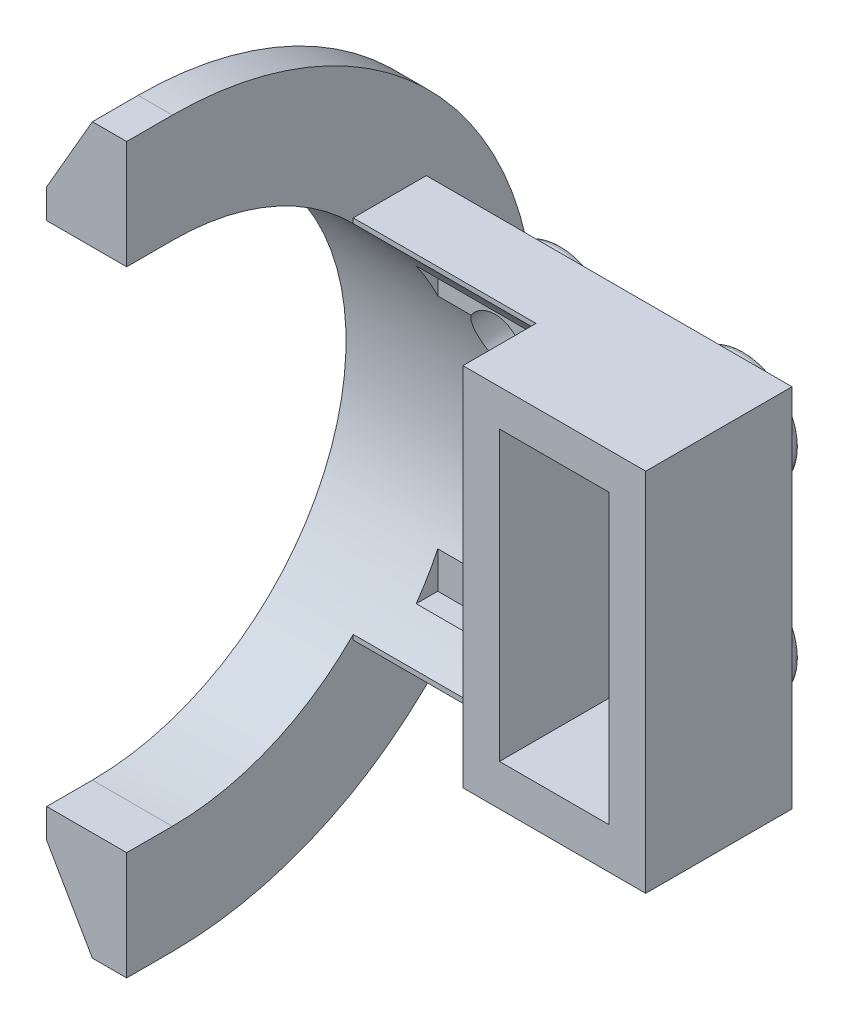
ISO-10303-21;
HEADER;
FILE_DESCRIPTION(('STEP AP214'),'2;1');
FILE_NAME('part.step','',(''),(''),'','','');
FILE_SCHEMA(('AUTOMOTIVE_DESIGN { 1 0 10303 214 1 1 1 1 }'));
ENDSEC;
DATA;
#1=APPLICATION_CONTEXT('core data for automotive mechanical design processes');
#2=APPLICATION_PROTOCOL_DEFINITION('international standard','automotive_design',2000,#1);
#3=PRODUCT_CONTEXT('',#1,'mechanical');
#4=PRODUCT('Part','Part','',(#3));
#5=PRODUCT_RELATED_PRODUCT_CATEGORY('part','',(#4));
#6=PRODUCT_DEFINITION_FORMATION('','',#4);
#7=PRODUCT_DEFINITION_CONTEXT('part definition',#1,'design');
#8=PRODUCT_DEFINITION('design','',#6,#7);
#9=PRODUCT_DEFINITION_SHAPE('','',#8);
#10=(LENGTH_UNIT() NAMED_UNIT(*) SI_UNIT(.MILLI.,.METRE.));
#11=(NAMED_UNIT(*) PLANE_ANGLE_UNIT() SI_UNIT($,.RADIAN.));
#12=(NAMED_UNIT(*) SI_UNIT($,.STERADIAN.) SOLID_ANGLE_UNIT());
#13=UNCERTAINTY_MEASURE_WITH_UNIT(LENGTH_MEASURE(1.E-05),#10,'distance_accuracy_value','');
#14=(GEOMETRIC_REPRESENTATION_CONTEXT(3) GLOBAL_UNCERTAINTY_ASSIGNED_CONTEXT((#13)) GLOBAL_UNIT_ASSIGNED_CONTEXT((#10,
#11,#12)) REPRESENTATION_CONTEXT('',''));
#15=CARTESIAN_POINT('',(0.,0.,0.));
#16=DIRECTION('',(0.,0.,1.));
#17=DIRECTION('',(1.,0.,0.));
#18=AXIS2_PLACEMENT_3D('',#15,#16,#17);
#19=CARTESIAN_POINT('',(0.,0.,3.2));
#20=DIRECTION('',(0.,0.,-1.));
#21=DIRECTION('',(-1.,0.,0.));
#22=AXIS2_PLACEMENT_3D('',#19,#20,#21);
#23=PLANE('',#22);
#24=DIRECTION('',(-1.,0.,0.));
#25=VECTOR('',#24,1.);
#26=CARTESIAN_POINT('',(-7.50000000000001,-15.7843348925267,3.2));
#27=LINE('',#26,#25);
#28=CARTESIAN_POINT('',(-8.,-15.7843348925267,3.2));
#29=VERTEX_POINT('',#28);
#30=CARTESIAN_POINT('',(-16.,-15.7843348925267,3.2));
#31=VERTEX_POINT('',#30);
#32=EDGE_CURVE('E227',#29,#31,#27,.T.);
#33=ORIENTED_EDGE('',*,*,#32,.T.);
#34=DIRECTION('',(0.,-1.,0.));
#35=VECTOR('',#34,1.);
#36=CARTESIAN_POINT('',(-16.,0.,3.2));
#37=LINE('',#36,#35);
#38=CARTESIAN_POINT('',(-16.,-16.,3.2));
#39=VERTEX_POINT('',#38);
#40=EDGE_CURVE('E230',#31,#39,#37,.T.);
#41=ORIENTED_EDGE('',*,*,#40,.T.);
#42=DIRECTION('',(1.,0.,0.));
#43=VECTOR('',#42,1.);
#44=CARTESIAN_POINT('',(0.,-16.,3.2));
#45=LINE('',#44,#43);
#46=CARTESIAN_POINT('',(-8.,-16.,3.2));
#47=VERTEX_POINT('',#46);
#48=EDGE_CURVE('E416',#39,#47,#45,.T.);
#49=ORIENTED_EDGE('',*,*,#48,.T.);
#50=DIRECTION('',(0.,-1.,0.));
#51=VECTOR('',#50,1.);
#52=CARTESIAN_POINT('',(-8.,0.,3.2));
#53=LINE('',#52,#51);
#54=EDGE_CURVE('E232',#29,#47,#53,.T.);
#55=ORIENTED_EDGE('',*,*,#54,.F.);
#56=EDGE_LOOP('',(#33,#41,#49,#55));
#57=FACE_BOUND('',#56,.T.);
#58=ADVANCED_FACE('F26',(#57),#23,.F.);
#59=DIRECTION('',(-1.,0.,0.));
#60=VECTOR('',#59,1.);
#61=CARTESIAN_POINT('',(-7.5,-0.215665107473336,3.2));
#62=LINE('',#61,#60);
#63=CARTESIAN_POINT('',(-8.,-0.215665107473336,3.2));
#64=VERTEX_POINT('',#63);
#65=CARTESIAN_POINT('',(-16.,-0.215665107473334,3.2));
#66=VERTEX_POINT('',#65);
#67=EDGE_CURVE('E590',#64,#66,#62,.T.);
#68=ORIENTED_EDGE('',*,*,#67,.F.);
#69=CARTESIAN_POINT('',(-8.,0.,3.2));
#70=VERTEX_POINT('',#69);
#71=EDGE_CURVE('E340',#70,#64,#53,.T.);
#72=ORIENTED_EDGE('',*,*,#71,.F.);
#73=DIRECTION('',(-1.,0.,0.));
#74=VECTOR('',#73,1.);
#75=CARTESIAN_POINT('',(0.,0.,3.2));
#76=LINE('',#75,#74);
#77=CARTESIAN_POINT('',(-16.,0.,3.2));
#78=VERTEX_POINT('',#77);
#79=EDGE_CURVE('E250',#70,#78,#76,.T.);
#80=ORIENTED_EDGE('',*,*,#79,.T.);
#81=EDGE_CURVE('E249',#78,#66,#37,.T.);
#82=ORIENTED_EDGE('',*,*,#81,.T.);
#83=EDGE_LOOP('',(#68,#72,#80,#82));
#84=FACE_BOUND('',#83,.T.);
#85=ADVANCED_FACE('F551',(#84),#23,.F.);
#86=CARTESIAN_POINT('',(-8.,0.,6.4));
#87=DIRECTION('',(1.,0.,0.));
#88=DIRECTION('',(0.,1.,0.));
#89=AXIS2_PLACEMENT_3D('',#86,#87,#88);
#90=PLANE('',#89);
#91=ORIENTED_EDGE('',*,*,#71,.T.);
#92=EDGE_CURVE('E344',#64,#29,#53,.T.);
#93=ORIENTED_EDGE('',*,*,#92,.T.);
#94=ORIENTED_EDGE('',*,*,#54,.T.);
#95=DIRECTION('',(0.,0.,-1.));
#96=VECTOR('',#95,1.);
#97=CARTESIAN_POINT('',(-8.,-16.,6.4));
#98=LINE('',#97,#96);
#99=CARTESIAN_POINT('',(-8.,-16.,6.4));
#100=VERTEX_POINT('',#99);
#101=EDGE_CURVE('E334',#100,#47,#98,.T.);
#102=ORIENTED_EDGE('',*,*,#101,.F.);
#103=DIRECTION('',(0.,-1.,0.));
#104=VECTOR('',#103,1.);
#105=CARTESIAN_POINT('',(-8.,0.,6.4));
#106=LINE('',#105,#104);
#107=CARTESIAN_POINT('',(-8.,0.,6.4));
#108=VERTEX_POINT('',#107);
#109=EDGE_CURVE('E321',#108,#100,#106,.T.);
#110=ORIENTED_EDGE('',*,*,#109,.F.);
#111=DIRECTION('',(0.,0.,-1.));
#112=VECTOR('',#111,1.);
#113=CARTESIAN_POINT('',(-8.,0.,6.4));
#114=LINE('',#113,#112);
#115=EDGE_CURVE('E332',#108,#70,#114,.T.);
#116=ORIENTED_EDGE('',*,*,#115,.T.);
#117=EDGE_LOOP('',(#91,#93,#94,#102,#110,#116));
#118=FACE_BOUND('',#117,.T.);
#119=ADVANCED_FACE('F557',(#118),#90,.F.);
#120=CARTESIAN_POINT('',(0.,0.,0.));
#121=DIRECTION('',(0.,0.,-1.));
#122=DIRECTION('',(-1.,0.,0.));
#123=AXIS2_PLACEMENT_3D('',#120,#121,#122);
#124=PLANE('',#123);
#125=CARTESIAN_POINT('',(-4.,-12.,0.));
#126=DIRECTION('',(0.,0.,-1.));
#127=DIRECTION('',(-1.,0.,0.));
#128=AXIS2_PLACEMENT_3D('',#125,#126,#127);
#129=CIRCLE('',#128,2.45);
#130=CARTESIAN_POINT('',(-1.54999999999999,-12.,0.));
#131=VERTEX_POINT('',#130);
#132=EDGE_CURVE('E368',#131,#131,#129,.T.);
#133=ORIENTED_EDGE('',*,*,#132,.F.);
#134=EDGE_LOOP('',(#133));
#135=FACE_BOUND('',#134,.T.);
#136=CARTESIAN_POINT('',(-4.,-4.,0.));
#137=DIRECTION('',(0.,0.,-1.));
#138=DIRECTION('',(-1.,0.,0.));
#139=AXIS2_PLACEMENT_3D('',#136,#137,#138);
#140=CIRCLE('',#139,2.45);
#141=CARTESIAN_POINT('',(-1.55,-4.,0.));
#142=VERTEX_POINT('',#141);
#143=EDGE_CURVE('E380',#142,#142,#140,.T.);
#144=ORIENTED_EDGE('',*,*,#143,.F.);
#145=EDGE_LOOP('',(#144));
#146=FACE_BOUND('',#145,.T.);
#147=DIRECTION('',(0.,1.,0.));
#148=VECTOR('',#147,1.);
#149=CARTESIAN_POINT('',(0.,0.,0.));
#150=LINE('',#149,#148);
#151=CARTESIAN_POINT('',(0.,-16.,0.));
#152=VERTEX_POINT('',#151);
#153=CARTESIAN_POINT('',(0.,0.,0.));
#154=VERTEX_POINT('',#153);
#155=EDGE_CURVE('E400',#152,#154,#150,.T.);
#156=ORIENTED_EDGE('',*,*,#155,.F.);
#157=DIRECTION('',(1.,0.,0.));
#158=VECTOR('',#157,1.);
#159=CARTESIAN_POINT('',(0.,-16.,0.));
#160=LINE('',#159,#158);
#161=CARTESIAN_POINT('',(-16.,-16.,0.));
#162=VERTEX_POINT('',#161);
#163=EDGE_CURVE('E411',#162,#152,#160,.T.);
#164=ORIENTED_EDGE('',*,*,#163,.F.);
#165=DIRECTION('',(0.,-1.,0.));
#166=VECTOR('',#165,1.);
#167=CARTESIAN_POINT('',(-16.,0.,0.));
#168=LINE('',#167,#166);
#169=CARTESIAN_POINT('',(-16.,0.,0.));
#170=VERTEX_POINT('',#169);
#171=EDGE_CURVE('E409',#170,#162,#168,.T.);
#172=ORIENTED_EDGE('',*,*,#171,.F.);
#173=DIRECTION('',(-1.,0.,0.));
#174=VECTOR('',#173,1.);
#175=CARTESIAN_POINT('',(0.,0.,0.));
#176=LINE('',#175,#174);
#177=EDGE_CURVE('E407',#154,#170,#176,.T.);
#178=ORIENTED_EDGE('',*,*,#177,.F.);
#179=EDGE_LOOP('',(#156,#164,#172,#178));
#180=FACE_BOUND('',#179,.T.);
#181=CARTESIAN_POINT('',(-12.,-4.,0.));
#182=DIRECTION('',(0.,0.,-1.));
#183=DIRECTION('',(-1.,0.,0.));
#184=AXIS2_PLACEMENT_3D('',#181,#182,#183);
#185=CIRCLE('',#184,2.45);
#186=CARTESIAN_POINT('',(-9.55,-4.,0.));
#187=VERTEX_POINT('',#186);
#188=EDGE_CURVE('E371',#187,#187,#185,.T.);
#189=ORIENTED_EDGE('',*,*,#188,.F.);
#190=EDGE_LOOP('',(#189));
#191=FACE_BOUND('',#190,.T.);
#192=CARTESIAN_POINT('',(-12.,-12.,0.));
#193=DIRECTION('',(0.,0.,-1.));
#194=DIRECTION('',(-1.,0.,0.));
#195=AXIS2_PLACEMENT_3D('',#192,#193,#194);
#196=CIRCLE('',#195,2.45);
#197=CARTESIAN_POINT('',(-9.54999999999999,-12.,0.));
#198=VERTEX_POINT('',#197);
#199=EDGE_CURVE('E365',#198,#198,#196,.T.);
#200=ORIENTED_EDGE('',*,*,#199,.F.);
#201=EDGE_LOOP('',(#200));
#202=FACE_BOUND('',#201,.T.);
#203=ADVANCED_FACE('F561',(#135,#146,#180,#191,#202),#124,.T.);
#204=CARTESIAN_POINT('',(0.,0.,3.2));
#205=DIRECTION('',(-1.,0.,0.));
#206=DIRECTION('',(0.,-1.,0.));
#207=AXIS2_PLACEMENT_3D('',#204,#205,#206);
#208=PLANE('',#207);
#209=DIRECTION('',(0.,0.,-1.));
#210=VECTOR('',#209,1.);
#211=CARTESIAN_POINT('',(0.,-16.,3.2));
#212=LINE('',#211,#210);
#213=CARTESIAN_POINT('',(0.,-16.,6.4));
#214=VERTEX_POINT('',#213);
#215=EDGE_CURVE('E418',#214,#152,#212,.T.);
#216=ORIENTED_EDGE('',*,*,#215,.T.);
#217=ORIENTED_EDGE('',*,*,#155,.T.);
#218=DIRECTION('',(0.,0.,-1.));
#219=VECTOR('',#218,1.);
#220=CARTESIAN_POINT('',(0.,0.,3.2));
#221=LINE('',#220,#219);
#222=CARTESIAN_POINT('',(0.,0.,6.4));
#223=VERTEX_POINT('',#222);
#224=EDGE_CURVE('E424',#223,#154,#221,.T.);
#225=ORIENTED_EDGE('',*,*,#224,.F.);
#226=DIRECTION('',(0.,1.,0.));
#227=VECTOR('',#226,1.);
#228=CARTESIAN_POINT('',(0.,0.,6.4));
#229=LINE('',#228,#227);
#230=EDGE_CURVE('E327',#214,#223,#229,.T.);
#231=ORIENTED_EDGE('',*,*,#230,.F.);
#232=EDGE_LOOP('',(#216,#217,#225,#231));
#233=FACE_BOUND('',#232,.T.);
#234=ADVANCED_FACE('F28',(#233),#208,.F.);
#235=CARTESIAN_POINT('',(0.,0.,3.2));
#236=DIRECTION('',(0.,-1.,0.));
#237=DIRECTION('',(1.,0.,0.));
#238=AXIS2_PLACEMENT_3D('',#235,#236,#237);
#239=PLANE('',#238);
#240=ORIENTED_EDGE('',*,*,#224,.T.);
#241=ORIENTED_EDGE('',*,*,#177,.T.);
#242=DIRECTION('',(0.,0.,-1.));
#243=VECTOR('',#242,1.);
#244=CARTESIAN_POINT('',(-16.,0.,3.2));
#245=LINE('',#244,#243);
#246=EDGE_CURVE('E421',#78,#170,#245,.T.);
#247=ORIENTED_EDGE('',*,*,#246,.F.);
#248=ORIENTED_EDGE('',*,*,#79,.F.);
#249=ORIENTED_EDGE('',*,*,#115,.F.);
#250=DIRECTION('',(-1.,0.,0.));
#251=VECTOR('',#250,1.);
#252=CARTESIAN_POINT('',(-8.,0.,6.4));
#253=LINE('',#252,#251);
#254=EDGE_CURVE('E330',#223,#108,#253,.T.);
#255=ORIENTED_EDGE('',*,*,#254,.F.);
#256=EDGE_LOOP('',(#240,#241,#247,#248,#249,#255));
#257=FACE_BOUND('',#256,.T.);
#258=ADVANCED_FACE('F566',(#257),#239,.F.);
#259=CARTESIAN_POINT('',(0.,-16.,3.2));
#260=DIRECTION('',(0.,1.,0.));
#261=DIRECTION('',(-1.,0.,0.));
#262=AXIS2_PLACEMENT_3D('',#259,#260,#261);
#263=PLANE('',#262);
#264=ORIENTED_EDGE('',*,*,#163,.T.);
#265=ORIENTED_EDGE('',*,*,#215,.F.);
#266=DIRECTION('',(1.,0.,0.));
#267=VECTOR('',#266,1.);
#268=CARTESIAN_POINT('',(-8.,-16.,6.4));
#269=LINE('',#268,#267);
#270=EDGE_CURVE('E324',#100,#214,#269,.T.);
#271=ORIENTED_EDGE('',*,*,#270,.F.);
#272=ORIENTED_EDGE('',*,*,#101,.T.);
#273=ORIENTED_EDGE('',*,*,#48,.F.);
#274=DIRECTION('',(0.,0.,-1.));
#275=VECTOR('',#274,1.);
#276=CARTESIAN_POINT('',(-16.,-16.,3.2));
#277=LINE('',#276,#275);
#278=EDGE_CURVE('E248',#39,#162,#277,.T.);
#279=ORIENTED_EDGE('',*,*,#278,.T.);
#280=EDGE_LOOP('',(#264,#265,#271,#272,#273,#279));
#281=FACE_BOUND('',#280,.T.);
#282=ADVANCED_FACE('F563',(#281),#263,.F.);
#283=CARTESIAN_POINT('',(-4.,-4.,-1.9));
#284=DIRECTION('',(0.,0.,1.));
#285=DIRECTION('',(1.,0.,0.));
#286=AXIS2_PLACEMENT_3D('',#283,#284,#285);
#287=CYLINDRICAL_SURFACE('',#286,2.45);
#288=CARTESIAN_POINT('',(-4.,-4.,-1.7));
#289=DIRECTION('',(0.,0.,-1.));
#290=DIRECTION('',(-1.,0.,0.));
#291=AXIS2_PLACEMENT_3D('',#288,#289,#290);
#292=CIRCLE('',#291,2.45);
#293=CARTESIAN_POINT('',(-1.55,-4.,-1.7));
#294=VERTEX_POINT('',#293);
#295=EDGE_CURVE('E429',#294,#294,#292,.F.);
#296=CARTESIAN_POINT('',(-1.55,-4.,-1.7));
#297=CARTESIAN_POINT('',(-1.55,-4.,-1.68229166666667));
#298=CARTESIAN_POINT('',(-1.55,-4.,-1.66458333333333));
#299=CARTESIAN_POINT('',(-1.55,-4.,-1.62916666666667));
#300=CARTESIAN_POINT('',(-1.55,-4.,-1.61145833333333));
#301=CARTESIAN_POINT('',(-1.55,-4.,-1.57604166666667));
#302=CARTESIAN_POINT('',(-1.55,-4.,-1.55833333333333));
#303=CARTESIAN_POINT('',(-1.55,-4.,-1.52291666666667));
#304=CARTESIAN_POINT('',(-1.55,-4.,-1.50520833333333));
#305=CARTESIAN_POINT('',(-1.55,-4.,-1.46979166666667));
#306=CARTESIAN_POINT('',(-1.55,-4.,-1.45208333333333));
#307=CARTESIAN_POINT('',(-1.55,-4.,-1.41666666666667));
#308=CARTESIAN_POINT('',(-1.55,-4.,-1.39895833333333));
#309=CARTESIAN_POINT('',(-1.55,-4.,-1.36354166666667));
#310=CARTESIAN_POINT('',(-1.55,-4.,-1.34583333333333));
#311=CARTESIAN_POINT('',(-1.55,-4.,-1.31041666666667));
#312=CARTESIAN_POINT('',(-1.55,-4.,-1.29270833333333));
#313=CARTESIAN_POINT('',(-1.55,-4.,-1.25729166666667));
#314=CARTESIAN_POINT('',(-1.55,-4.,-1.23958333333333));
#315=CARTESIAN_POINT('',(-1.55,-4.,-1.20416666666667));
#316=CARTESIAN_POINT('',(-1.55,-4.,-1.18645833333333));
#317=CARTESIAN_POINT('',(-1.55,-4.,-1.15104166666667));
#318=CARTESIAN_POINT('',(-1.55,-4.,-1.13333333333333));
#319=CARTESIAN_POINT('',(-1.55,-4.,-1.09791666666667));
#320=CARTESIAN_POINT('',(-1.55,-4.,-1.08020833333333));
#321=CARTESIAN_POINT('',(-1.55,-4.,-1.04479166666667));
#322=CARTESIAN_POINT('',(-1.55,-4.,-1.02708333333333));
#323=CARTESIAN_POINT('',(-1.55,-4.,-0.991666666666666));
#324=CARTESIAN_POINT('',(-1.55,-4.,-0.973958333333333));
#325=CARTESIAN_POINT('',(-1.55,-4.,-0.938541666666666));
#326=CARTESIAN_POINT('',(-1.55,-4.,-0.920833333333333));
#327=CARTESIAN_POINT('',(-1.55,-4.,-0.885416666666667));
#328=CARTESIAN_POINT('',(-1.55,-4.,-0.867708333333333));
#329=CARTESIAN_POINT('',(-1.55,-4.,-0.832291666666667));
#330=CARTESIAN_POINT('',(-1.55,-4.,-0.814583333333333));
#331=CARTESIAN_POINT('',(-1.55,-4.,-0.779166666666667));
#332=CARTESIAN_POINT('',(-1.55,-4.,-0.761458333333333));
#333=CARTESIAN_POINT('',(-1.55,-4.,-0.726041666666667));
#334=CARTESIAN_POINT('',(-1.55,-4.,-0.708333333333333));
#335=CARTESIAN_POINT('',(-1.55,-4.,-0.672916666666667));
#336=CARTESIAN_POINT('',(-1.55,-4.,-0.655208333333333));
#337=CARTESIAN_POINT('',(-1.55,-4.,-0.619791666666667));
#338=CARTESIAN_POINT('',(-1.55,-4.,-0.602083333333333));
#339=CARTESIAN_POINT('',(-1.55,-4.,-0.566666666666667));
#340=CARTESIAN_POINT('',(-1.55,-4.,-0.548958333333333));
#341=CARTESIAN_POINT('',(-1.55,-4.,-0.513541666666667));
#342=CARTESIAN_POINT('',(-1.55,-4.,-0.495833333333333));
#343=CARTESIAN_POINT('',(-1.55,-4.,-0.460416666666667));
#344=CARTESIAN_POINT('',(-1.55,-4.,-0.442708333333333));
#345=CARTESIAN_POINT('',(-1.55,-4.,-0.407291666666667));
#346=CARTESIAN_POINT('',(-1.55,-4.,-0.389583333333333));
#347=CARTESIAN_POINT('',(-1.55,-4.,-0.354166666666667));
#348=CARTESIAN_POINT('',(-1.55,-4.,-0.336458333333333));
#349=CARTESIAN_POINT('',(-1.55,-4.,-0.301041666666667));
#350=CARTESIAN_POINT('',(-1.55,-4.,-0.283333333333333));
#351=CARTESIAN_POINT('',(-1.55,-4.,-0.247916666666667));
#352=CARTESIAN_POINT('',(-1.55,-4.,-0.230208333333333));
#353=CARTESIAN_POINT('',(-1.55,-4.,-0.194791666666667));
#354=CARTESIAN_POINT('',(-1.55,-4.,-0.177083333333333));
#355=CARTESIAN_POINT('',(-1.55,-4.,-0.141666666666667));
#356=CARTESIAN_POINT('',(-1.55,-4.,-0.123958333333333));
#357=CARTESIAN_POINT('',(-1.55,-4.,-0.0885416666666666));
#358=CARTESIAN_POINT('',(-1.55,-4.,-0.0708333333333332));
#359=CARTESIAN_POINT('',(-1.55,-4.,-0.0354166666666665));
#360=CARTESIAN_POINT('',(-1.55,-4.,-0.0177083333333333));
#361=CARTESIAN_POINT('',(-1.55,-4.,0.));
#362=B_SPLINE_CURVE_WITH_KNOTS('',3,(#296,#297,#298,#299,#300,#301,#302,#303,#304,#305,#306,
#307,#308,#309,#310,#311,#312,#313,#314,#315,#316,#317,#318,#319,#320,#321,#322,#323,#324,#325,
#326,#327,#328,#329,#330,#331,#332,#333,#334,#335,#336,#337,#338,#339,#340,#341,#342,#343,#344,
#345,#346,#347,#348,#349,#350,#351,#352,#353,#354,#355,#356,#357,#358,#359,#360,#361),
.UNSPECIFIED.,.F.,.F.,(4,2,2,2,2,2,2,2,2,2,2,2,2,2,2,2,2,2,2,2,2,2,2,2,2,2,2,2,2,2,2,2,4),(0.,
0.053125,0.10625,0.159375,0.2125,0.265625,0.31875,0.371875,0.425,0.478125,0.53125,0.584375,
0.6375,0.690625,0.74375,0.796875,0.85,0.903125,0.95625,1.009375,1.0625,1.115625,1.16875,
1.221875,1.275,1.328125,1.38125,1.434375,1.4875,1.540625,1.59375,1.646875,1.7),.UNSPECIFIED.);
#363=EDGE_CURVE('BSEAM565',#294,#142,#362,.T.);
#364=ORIENTED_EDGE('',*,*,#295,.T.);
#365=ORIENTED_EDGE('',*,*,#143,.T.);
#366=ORIENTED_EDGE('',*,*,#363,.T.);
#367=ORIENTED_EDGE('',*,*,#363,.F.);
#368=EDGE_LOOP('',(#364,#366,#365,#367));
#369=FACE_BOUND('',#368,.T.);
#370=ADVANCED_FACE('F565',(#369),#287,.T.);
#371=CARTESIAN_POINT('',(-4.,-4.,-1.9));
#372=DIRECTION('',(0.,0.,-1.));
#373=DIRECTION('',(-1.,0.,0.));
#374=AXIS2_PLACEMENT_3D('',#371,#372,#373);
#375=PLANE('',#374);
#376=CARTESIAN_POINT('',(-4.,-4.,-1.9));
#377=DIRECTION('',(0.,0.,-1.));
#378=DIRECTION('',(-1.,0.,0.));
#379=AXIS2_PLACEMENT_3D('',#376,#377,#378);
#380=CIRCLE('',#379,2.25);
#381=CARTESIAN_POINT('',(-6.25,-4.,-1.9));
#382=VERTEX_POINT('',#381);
#383=EDGE_CURVE('E426',#382,#382,#380,.T.);
#384=ORIENTED_EDGE('',*,*,#383,.T.);
#385=EDGE_LOOP('',(#384));
#386=FACE_BOUND('',#385,.T.);
#387=ADVANCED_FACE('F766',(#386),#375,.T.);
#388=CARTESIAN_POINT('',(-4.,-4.,-1.7));
#389=DIRECTION('',(0.,0.,-1.));
#390=DIRECTION('',(-1.,0.,0.));
#391=AXIS2_PLACEMENT_3D('',#388,#389,#390);
#392=TOROIDAL_SURFACE('',#391,2.25,0.2);
#393=ORIENTED_EDGE('',*,*,#295,.F.);
#394=EDGE_LOOP('',(#393));
#395=FACE_BOUND('',#394,.T.);
#396=ORIENTED_EDGE('',*,*,#383,.F.);
#397=EDGE_LOOP('',(#396));
#398=FACE_BOUND('',#397,.T.);
#399=ADVANCED_FACE('F756',(#395,#398),#392,.T.);
#400=CARTESIAN_POINT('',(-12.,-4.,-1.9));
#401=DIRECTION('',(0.,0.,1.));
#402=DIRECTION('',(1.,0.,0.));
#403=AXIS2_PLACEMENT_3D('',#400,#401,#402);
#404=CYLINDRICAL_SURFACE('',#403,2.45);
#405=CARTESIAN_POINT('',(-12.,-4.,-1.7));
#406=DIRECTION('',(0.,0.,-1.));
#407=DIRECTION('',(-1.,0.,0.));
#408=AXIS2_PLACEMENT_3D('',#405,#406,#407);
#409=CIRCLE('',#408,2.45);
#410=CARTESIAN_POINT('',(-9.55,-4.,-1.7));
#411=VERTEX_POINT('',#410);
#412=EDGE_CURVE('E435',#411,#411,#409,.F.);
#413=CARTESIAN_POINT('',(-9.55,-4.,-1.7));
#414=CARTESIAN_POINT('',(-9.55,-4.,-1.68229166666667));
#415=CARTESIAN_POINT('',(-9.55,-4.,-1.66458333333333));
#416=CARTESIAN_POINT('',(-9.55,-4.,-1.62916666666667));
#417=CARTESIAN_POINT('',(-9.55,-4.,-1.61145833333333));
#418=CARTESIAN_POINT('',(-9.55,-4.,-1.57604166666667));
#419=CARTESIAN_POINT('',(-9.55,-4.,-1.55833333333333));
#420=CARTESIAN_POINT('',(-9.55,-4.,-1.52291666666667));
#421=CARTESIAN_POINT('',(-9.55,-4.,-1.50520833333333));
#422=CARTESIAN_POINT('',(-9.55,-4.,-1.46979166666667));
#423=CARTESIAN_POINT('',(-9.55,-4.,-1.45208333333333));
#424=CARTESIAN_POINT('',(-9.55,-4.,-1.41666666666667));
#425=CARTESIAN_POINT('',(-9.55,-4.,-1.39895833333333));
#426=CARTESIAN_POINT('',(-9.55,-4.,-1.36354166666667));
#427=CARTESIAN_POINT('',(-9.55,-4.,-1.34583333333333));
#428=CARTESIAN_POINT('',(-9.55,-4.,-1.31041666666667));
#429=CARTESIAN_POINT('',(-9.55,-4.,-1.29270833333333));
#430=CARTESIAN_POINT('',(-9.55,-4.,-1.25729166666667));
#431=CARTESIAN_POINT('',(-9.55,-4.,-1.23958333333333));
#432=CARTESIAN_POINT('',(-9.55,-4.,-1.20416666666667));
#433=CARTESIAN_POINT('',(-9.55,-4.,-1.18645833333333));
#434=CARTESIAN_POINT('',(-9.55,-4.,-1.15104166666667));
#435=CARTESIAN_POINT('',(-9.55,-4.,-1.13333333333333));
#436=CARTESIAN_POINT('',(-9.55,-4.,-1.09791666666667));
#437=CARTESIAN_POINT('',(-9.55,-4.,-1.08020833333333));
#438=CARTESIAN_POINT('',(-9.55,-4.,-1.04479166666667));
#439=CARTESIAN_POINT('',(-9.55,-4.,-1.02708333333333));
#440=CARTESIAN_POINT('',(-9.55,-4.,-0.991666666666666));
#441=CARTESIAN_POINT('',(-9.55,-4.,-0.973958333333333));
#442=CARTESIAN_POINT('',(-9.55,-4.,-0.938541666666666));
#443=CARTESIAN_POINT('',(-9.55,-4.,-0.920833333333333));
#444=CARTESIAN_POINT('',(-9.55,-4.,-0.885416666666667));
#445=CARTESIAN_POINT('',(-9.55,-4.,-0.867708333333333));
#446=CARTESIAN_POINT('',(-9.55,-4.,-0.832291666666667));
#447=CARTESIAN_POINT('',(-9.55,-4.,-0.814583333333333));
#448=CARTESIAN_POINT('',(-9.55,-4.,-0.779166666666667));
#449=CARTESIAN_POINT('',(-9.55,-4.,-0.761458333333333));
#450=CARTESIAN_POINT('',(-9.55,-4.,-0.726041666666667));
#451=CARTESIAN_POINT('',(-9.55,-4.,-0.708333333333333));
#452=CARTESIAN_POINT('',(-9.55,-4.,-0.672916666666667));
#453=CARTESIAN_POINT('',(-9.55,-4.,-0.655208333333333));
#454=CARTESIAN_POINT('',(-9.55,-4.,-0.619791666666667));
#455=CARTESIAN_POINT('',(-9.55,-4.,-0.602083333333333));
#456=CARTESIAN_POINT('',(-9.55,-4.,-0.566666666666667));
#457=CARTESIAN_POINT('',(-9.55,-4.,-0.548958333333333));
#458=CARTESIAN_POINT('',(-9.55,-4.,-0.513541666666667));
#459=CARTESIAN_POINT('',(-9.55,-4.,-0.495833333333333));
#460=CARTESIAN_POINT('',(-9.55,-4.,-0.460416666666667));
#461=CARTESIAN_POINT('',(-9.55,-4.,-0.442708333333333));
#462=CARTESIAN_POINT('',(-9.55,-4.,-0.407291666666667));
#463=CARTESIAN_POINT('',(-9.55,-4.,-0.389583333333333));
#464=CARTESIAN_POINT('',(-9.55,-4.,-0.354166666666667));
#465=CARTESIAN_POINT('',(-9.55,-4.,-0.336458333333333));
#466=CARTESIAN_POINT('',(-9.55,-4.,-0.301041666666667));
#467=CARTESIAN_POINT('',(-9.55,-4.,-0.283333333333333));
#468=CARTESIAN_POINT('',(-9.55,-4.,-0.247916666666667));
#469=CARTESIAN_POINT('',(-9.55,-4.,-0.230208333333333));
#470=CARTESIAN_POINT('',(-9.55,-4.,-0.194791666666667));
#471=CARTESIAN_POINT('',(-9.55,-4.,-0.177083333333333));
#472=CARTESIAN_POINT('',(-9.55,-4.,-0.141666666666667));
#473=CARTESIAN_POINT('',(-9.55,-4.,-0.123958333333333));
#474=CARTESIAN_POINT('',(-9.55,-4.,-0.0885416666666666));
#475=CARTESIAN_POINT('',(-9.55,-4.,-0.0708333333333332));
#476=CARTESIAN_POINT('',(-9.55,-4.,-0.0354166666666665));
#477=CARTESIAN_POINT('',(-9.55,-4.,-0.0177083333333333));
#478=CARTESIAN_POINT('',(-9.55,-4.,0.));
#479=B_SPLINE_CURVE_WITH_KNOTS('',3,(#413,#414,#415,#416,#417,#418,#419,#420,#421,#422,#423,
#424,#425,#426,#427,#428,#429,#430,#431,#432,#433,#434,#435,#436,#437,#438,#439,#440,#441,#442,
#443,#444,#445,#446,#447,#448,#449,#450,#451,#452,#453,#454,#455,#456,#457,#458,#459,#460,#461,
#462,#463,#464,#465,#466,#467,#468,#469,#470,#471,#472,#473,#474,#475,#476,#477,#478),
.UNSPECIFIED.,.F.,.F.,(4,2,2,2,2,2,2,2,2,2,2,2,2,2,2,2,2,2,2,2,2,2,2,2,2,2,2,2,2,2,2,2,4),(0.,
0.053125,0.10625,0.159375,0.2125,0.265625,0.31875,0.371875,0.425,0.478125,0.53125,0.584375,
0.6375,0.690625,0.74375,0.796875,0.85,0.903125,0.95625,1.009375,1.0625,1.115625,1.16875,
1.221875,1.275,1.328125,1.38125,1.434375,1.4875,1.540625,1.59375,1.646875,1.7),.UNSPECIFIED.);
#480=EDGE_CURVE('BSEAM752',#411,#187,#479,.T.);
#481=ORIENTED_EDGE('',*,*,#412,.T.);
#482=ORIENTED_EDGE('',*,*,#188,.T.);
#483=ORIENTED_EDGE('',*,*,#480,.T.);
#484=ORIENTED_EDGE('',*,*,#480,.F.);
#485=EDGE_LOOP('',(#481,#483,#482,#484));
#486=FACE_BOUND('',#485,.T.);
#487=ADVANCED_FACE('F752',(#486),#404,.T.);
#488=CARTESIAN_POINT('',(-12.,-4.,-1.9));
#489=DIRECTION('',(0.,0.,-1.));
#490=DIRECTION('',(-1.,0.,0.));
#491=AXIS2_PLACEMENT_3D('',#488,#489,#490);
#492=PLANE('',#491);
#493=CARTESIAN_POINT('',(-12.,-4.,-1.9));
#494=DIRECTION('',(0.,0.,-1.));
#495=DIRECTION('',(-1.,0.,0.));
#496=AXIS2_PLACEMENT_3D('',#493,#494,#495);
#497=CIRCLE('',#496,2.25);
#498=CARTESIAN_POINT('',(-14.25,-4.,-1.9));
#499=VERTEX_POINT('',#498);
#500=EDGE_CURVE('E432',#499,#499,#497,.T.);
#501=ORIENTED_EDGE('',*,*,#500,.T.);
#502=EDGE_LOOP('',(#501));
#503=FACE_BOUND('',#502,.T.);
#504=ADVANCED_FACE('F748',(#503),#492,.T.);
#505=CARTESIAN_POINT('',(-4.,-12.,-1.9));
#506=DIRECTION('',(0.,0.,1.));
#507=DIRECTION('',(1.,0.,0.));
#508=AXIS2_PLACEMENT_3D('',#505,#506,#507);
#509=CYLINDRICAL_SURFACE('',#508,2.45);
#510=CARTESIAN_POINT('',(-4.,-12.,-1.7));
#511=DIRECTION('',(0.,0.,-1.));
#512=DIRECTION('',(-1.,0.,0.));
#513=AXIS2_PLACEMENT_3D('',#510,#511,#512);
#514=CIRCLE('',#513,2.45);
#515=CARTESIAN_POINT('',(-1.54999999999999,-12.,-1.7));
#516=VERTEX_POINT('',#515);
#517=EDGE_CURVE('E441',#516,#516,#514,.F.);
#518=CARTESIAN_POINT('',(-1.54999999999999,-12.,-1.7));
#519=CARTESIAN_POINT('',(-1.54999999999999,-12.,-1.68229166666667));
#520=CARTESIAN_POINT('',(-1.54999999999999,-12.,-1.66458333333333));
#521=CARTESIAN_POINT('',(-1.54999999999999,-12.,-1.62916666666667));
#522=CARTESIAN_POINT('',(-1.54999999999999,-12.,-1.61145833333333));
#523=CARTESIAN_POINT('',(-1.54999999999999,-12.,-1.57604166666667));
#524=CARTESIAN_POINT('',(-1.54999999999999,-12.,-1.55833333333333));
#525=CARTESIAN_POINT('',(-1.54999999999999,-12.,-1.52291666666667));
#526=CARTESIAN_POINT('',(-1.54999999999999,-12.,-1.50520833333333));
#527=CARTESIAN_POINT('',(-1.54999999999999,-12.,-1.46979166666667));
#528=CARTESIAN_POINT('',(-1.54999999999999,-12.,-1.45208333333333));
#529=CARTESIAN_POINT('',(-1.54999999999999,-12.,-1.41666666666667));
#530=CARTESIAN_POINT('',(-1.54999999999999,-12.,-1.39895833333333));
#531=CARTESIAN_POINT('',(-1.54999999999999,-12.,-1.36354166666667));
#532=CARTESIAN_POINT('',(-1.54999999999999,-12.,-1.34583333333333));
#533=CARTESIAN_POINT('',(-1.54999999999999,-12.,-1.31041666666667));
#534=CARTESIAN_POINT('',(-1.54999999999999,-12.,-1.29270833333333));
#535=CARTESIAN_POINT('',(-1.54999999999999,-12.,-1.25729166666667));
#536=CARTESIAN_POINT('',(-1.54999999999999,-12.,-1.23958333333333));
#537=CARTESIAN_POINT('',(-1.54999999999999,-12.,-1.20416666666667));
#538=CARTESIAN_POINT('',(-1.54999999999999,-12.,-1.18645833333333));
#539=CARTESIAN_POINT('',(-1.54999999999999,-12.,-1.15104166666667));
#540=CARTESIAN_POINT('',(-1.54999999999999,-12.,-1.13333333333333));
#541=CARTESIAN_POINT('',(-1.54999999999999,-12.,-1.09791666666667));
#542=CARTESIAN_POINT('',(-1.54999999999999,-12.,-1.08020833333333));
#543=CARTESIAN_POINT('',(-1.54999999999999,-12.,-1.04479166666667));
#544=CARTESIAN_POINT('',(-1.54999999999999,-12.,-1.02708333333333));
#545=CARTESIAN_POINT('',(-1.54999999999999,-12.,-0.991666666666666));
#546=CARTESIAN_POINT('',(-1.54999999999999,-12.,-0.973958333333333));
#547=CARTESIAN_POINT('',(-1.54999999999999,-12.,-0.938541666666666));
#548=CARTESIAN_POINT('',(-1.54999999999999,-12.,-0.920833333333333));
#549=CARTESIAN_POINT('',(-1.54999999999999,-12.,-0.885416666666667));
#550=CARTESIAN_POINT('',(-1.54999999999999,-12.,-0.867708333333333));
#551=CARTESIAN_POINT('',(-1.54999999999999,-12.,-0.832291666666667));
#552=CARTESIAN_POINT('',(-1.54999999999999,-12.,-0.814583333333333));
#553=CARTESIAN_POINT('',(-1.54999999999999,-12.,-0.779166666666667));
#554=CARTESIAN_POINT('',(-1.54999999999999,-12.,-0.761458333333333));
#555=CARTESIAN_POINT('',(-1.54999999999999,-12.,-0.726041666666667));
#556=CARTESIAN_POINT('',(-1.54999999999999,-12.,-0.708333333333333));
#557=CARTESIAN_POINT('',(-1.54999999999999,-12.,-0.672916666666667));
#558=CARTESIAN_POINT('',(-1.54999999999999,-12.,-0.655208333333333));
#559=CARTESIAN_POINT('',(-1.54999999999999,-12.,-0.619791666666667));
#560=CARTESIAN_POINT('',(-1.54999999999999,-12.,-0.602083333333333));
#561=CARTESIAN_POINT('',(-1.54999999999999,-12.,-0.566666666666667));
#562=CARTESIAN_POINT('',(-1.54999999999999,-12.,-0.548958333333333));
#563=CARTESIAN_POINT('',(-1.54999999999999,-12.,-0.513541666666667));
#564=CARTESIAN_POINT('',(-1.54999999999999,-12.,-0.495833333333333));
#565=CARTESIAN_POINT('',(-1.54999999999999,-12.,-0.460416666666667));
#566=CARTESIAN_POINT('',(-1.54999999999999,-12.,-0.442708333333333));
#567=CARTESIAN_POINT('',(-1.54999999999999,-12.,-0.407291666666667));
#568=CARTESIAN_POINT('',(-1.54999999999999,-12.,-0.389583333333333));
#569=CARTESIAN_POINT('',(-1.54999999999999,-12.,-0.354166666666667));
#570=CARTESIAN_POINT('',(-1.54999999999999,-12.,-0.336458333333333));
#571=CARTESIAN_POINT('',(-1.54999999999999,-12.,-0.301041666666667));
#572=CARTESIAN_POINT('',(-1.54999999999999,-12.,-0.283333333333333));
#573=CARTESIAN_POINT('',(-1.54999999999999,-12.,-0.247916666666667));
#574=CARTESIAN_POINT('',(-1.54999999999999,-12.,-0.230208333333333));
#575=CARTESIAN_POINT('',(-1.54999999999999,-12.,-0.194791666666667));
#576=CARTESIAN_POINT('',(-1.54999999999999,-12.,-0.177083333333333));
#577=CARTESIAN_POINT('',(-1.54999999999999,-12.,-0.141666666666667));
#578=CARTESIAN_POINT('',(-1.54999999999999,-12.,-0.123958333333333));
#579=CARTESIAN_POINT('',(-1.54999999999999,-12.,-0.0885416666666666));
#580=CARTESIAN_POINT('',(-1.54999999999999,-12.,-0.0708333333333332));
#581=CARTESIAN_POINT('',(-1.54999999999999,-12.,-0.0354166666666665));
#582=CARTESIAN_POINT('',(-1.54999999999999,-12.,-0.0177083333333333));
#583=CARTESIAN_POINT('',(-1.54999999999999,-12.,0.));
#584=B_SPLINE_CURVE_WITH_KNOTS('',3,(#518,#519,#520,#521,#522,#523,#524,#525,#526,#527,#528,
#529,#530,#531,#532,#533,#534,#535,#536,#537,#538,#539,#540,#541,#542,#543,#544,#545,#546,#547,
#548,#549,#550,#551,#552,#553,#554,#555,#556,#557,#558,#559,#560,#561,#562,#563,#564,#565,#566,
#567,#568,#569,#570,#571,#572,#573,#574,#575,#576,#577,#578,#579,#580,#581,#582,#583),
.UNSPECIFIED.,.F.,.F.,(4,2,2,2,2,2,2,2,2,2,2,2,2,2,2,2,2,2,2,2,2,2,2,2,2,2,2,2,2,2,2,2,4),(0.,
0.053125,0.10625,0.159375,0.2125,0.265625,0.31875,0.371875,0.425,0.478125,0.53125,0.584375,
0.6375,0.690625,0.74375,0.796875,0.85,0.903125,0.95625,1.009375,1.0625,1.115625,1.16875,
1.221875,1.275,1.328125,1.38125,1.434375,1.4875,1.540625,1.59375,1.646875,1.7),.UNSPECIFIED.);
#585=EDGE_CURVE('BSEAM744',#516,#131,#584,.T.);
#586=ORIENTED_EDGE('',*,*,#517,.T.);
#587=ORIENTED_EDGE('',*,*,#132,.T.);
#588=ORIENTED_EDGE('',*,*,#585,.T.);
#589=ORIENTED_EDGE('',*,*,#585,.F.);
#590=EDGE_LOOP('',(#586,#588,#587,#589));
#591=FACE_BOUND('',#590,.T.);
#592=ADVANCED_FACE('F744',(#591),#509,.T.);
#593=CARTESIAN_POINT('',(-4.,-12.,-1.9));
#594=DIRECTION('',(0.,0.,-1.));
#595=DIRECTION('',(-1.,0.,0.));
#596=AXIS2_PLACEMENT_3D('',#593,#594,#595);
#597=PLANE('',#596);
#598=CARTESIAN_POINT('',(-4.,-12.,-1.9));
#599=DIRECTION('',(0.,0.,-1.));
#600=DIRECTION('',(-1.,0.,0.));
#601=AXIS2_PLACEMENT_3D('',#598,#599,#600);
#602=CIRCLE('',#601,2.25);
#603=CARTESIAN_POINT('',(-6.25,-12.,-1.9));
#604=VERTEX_POINT('',#603);
#605=EDGE_CURVE('E438',#604,#604,#602,.T.);
#606=ORIENTED_EDGE('',*,*,#605,.T.);
#607=EDGE_LOOP('',(#606));
#608=FACE_BOUND('',#607,.T.);
#609=ADVANCED_FACE('F740',(#608),#597,.T.);
#610=CARTESIAN_POINT('',(-12.,-12.,-1.9));
#611=DIRECTION('',(0.,0.,1.));
#612=DIRECTION('',(1.,0.,0.));
#613=AXIS2_PLACEMENT_3D('',#610,#611,#612);
#614=CYLINDRICAL_SURFACE('',#613,2.45);
#615=CARTESIAN_POINT('',(-12.,-12.,-1.7));
#616=DIRECTION('',(0.,0.,-1.));
#617=DIRECTION('',(-1.,0.,0.));
#618=AXIS2_PLACEMENT_3D('',#615,#616,#617);
#619=CIRCLE('',#618,2.45);
#620=CARTESIAN_POINT('',(-9.54999999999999,-12.,-1.7));
#621=VERTEX_POINT('',#620);
#622=EDGE_CURVE('E447',#621,#621,#619,.F.);
#623=CARTESIAN_POINT('',(-9.54999999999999,-12.,-1.7));
#624=CARTESIAN_POINT('',(-9.54999999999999,-12.,-1.68229166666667));
#625=CARTESIAN_POINT('',(-9.54999999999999,-12.,-1.66458333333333));
#626=CARTESIAN_POINT('',(-9.54999999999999,-12.,-1.62916666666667));
#627=CARTESIAN_POINT('',(-9.54999999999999,-12.,-1.61145833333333));
#628=CARTESIAN_POINT('',(-9.54999999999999,-12.,-1.57604166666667));
#629=CARTESIAN_POINT('',(-9.54999999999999,-12.,-1.55833333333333));
#630=CARTESIAN_POINT('',(-9.54999999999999,-12.,-1.52291666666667));
#631=CARTESIAN_POINT('',(-9.54999999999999,-12.,-1.50520833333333));
#632=CARTESIAN_POINT('',(-9.54999999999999,-12.,-1.46979166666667));
#633=CARTESIAN_POINT('',(-9.54999999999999,-12.,-1.45208333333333));
#634=CARTESIAN_POINT('',(-9.54999999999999,-12.,-1.41666666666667));
#635=CARTESIAN_POINT('',(-9.54999999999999,-12.,-1.39895833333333));
#636=CARTESIAN_POINT('',(-9.54999999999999,-12.,-1.36354166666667));
#637=CARTESIAN_POINT('',(-9.54999999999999,-12.,-1.34583333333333));
#638=CARTESIAN_POINT('',(-9.54999999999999,-12.,-1.31041666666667));
#639=CARTESIAN_POINT('',(-9.54999999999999,-12.,-1.29270833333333));
#640=CARTESIAN_POINT('',(-9.54999999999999,-12.,-1.25729166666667));
#641=CARTESIAN_POINT('',(-9.54999999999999,-12.,-1.23958333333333));
#642=CARTESIAN_POINT('',(-9.54999999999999,-12.,-1.20416666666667));
#643=CARTESIAN_POINT('',(-9.54999999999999,-12.,-1.18645833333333));
#644=CARTESIAN_POINT('',(-9.54999999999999,-12.,-1.15104166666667));
#645=CARTESIAN_POINT('',(-9.54999999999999,-12.,-1.13333333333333));
#646=CARTESIAN_POINT('',(-9.54999999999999,-12.,-1.09791666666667));
#647=CARTESIAN_POINT('',(-9.54999999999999,-12.,-1.08020833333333));
#648=CARTESIAN_POINT('',(-9.54999999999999,-12.,-1.04479166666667));
#649=CARTESIAN_POINT('',(-9.54999999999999,-12.,-1.02708333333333));
#650=CARTESIAN_POINT('',(-9.54999999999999,-12.,-0.991666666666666));
#651=CARTESIAN_POINT('',(-9.54999999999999,-12.,-0.973958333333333));
#652=CARTESIAN_POINT('',(-9.54999999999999,-12.,-0.938541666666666));
#653=CARTESIAN_POINT('',(-9.54999999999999,-12.,-0.920833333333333));
#654=CARTESIAN_POINT('',(-9.54999999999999,-12.,-0.885416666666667));
#655=CARTESIAN_POINT('',(-9.54999999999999,-12.,-0.867708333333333));
#656=CARTESIAN_POINT('',(-9.54999999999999,-12.,-0.832291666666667));
#657=CARTESIAN_POINT('',(-9.54999999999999,-12.,-0.814583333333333));
#658=CARTESIAN_POINT('',(-9.54999999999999,-12.,-0.779166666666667));
#659=CARTESIAN_POINT('',(-9.54999999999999,-12.,-0.761458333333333));
#660=CARTESIAN_POINT('',(-9.54999999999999,-12.,-0.726041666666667));
#661=CARTESIAN_POINT('',(-9.54999999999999,-12.,-0.708333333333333));
#662=CARTESIAN_POINT('',(-9.54999999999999,-12.,-0.672916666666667));
#663=CARTESIAN_POINT('',(-9.54999999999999,-12.,-0.655208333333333));
#664=CARTESIAN_POINT('',(-9.54999999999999,-12.,-0.619791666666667));
#665=CARTESIAN_POINT('',(-9.54999999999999,-12.,-0.602083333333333));
#666=CARTESIAN_POINT('',(-9.54999999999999,-12.,-0.566666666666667));
#667=CARTESIAN_POINT('',(-9.54999999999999,-12.,-0.548958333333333));
#668=CARTESIAN_POINT('',(-9.54999999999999,-12.,-0.513541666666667));
#669=CARTESIAN_POINT('',(-9.54999999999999,-12.,-0.495833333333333));
#670=CARTESIAN_POINT('',(-9.54999999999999,-12.,-0.460416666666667));
#671=CARTESIAN_POINT('',(-9.54999999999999,-12.,-0.442708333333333));
#672=CARTESIAN_POINT('',(-9.54999999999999,-12.,-0.407291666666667));
#673=CARTESIAN_POINT('',(-9.54999999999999,-12.,-0.389583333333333));
#674=CARTESIAN_POINT('',(-9.54999999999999,-12.,-0.354166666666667));
#675=CARTESIAN_POINT('',(-9.54999999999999,-12.,-0.336458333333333));
#676=CARTESIAN_POINT('',(-9.54999999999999,-12.,-0.301041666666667));
#677=CARTESIAN_POINT('',(-9.54999999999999,-12.,-0.283333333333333));
#678=CARTESIAN_POINT('',(-9.54999999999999,-12.,-0.247916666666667));
#679=CARTESIAN_POINT('',(-9.54999999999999,-12.,-0.230208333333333));
#680=CARTESIAN_POINT('',(-9.54999999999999,-12.,-0.194791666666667));
#681=CARTESIAN_POINT('',(-9.54999999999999,-12.,-0.177083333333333));
#682=CARTESIAN_POINT('',(-9.54999999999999,-12.,-0.141666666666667));
#683=CARTESIAN_POINT('',(-9.54999999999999,-12.,-0.123958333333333));
#684=CARTESIAN_POINT('',(-9.54999999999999,-12.,-0.0885416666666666));
#685=CARTESIAN_POINT('',(-9.54999999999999,-12.,-0.0708333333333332));
#686=CARTESIAN_POINT('',(-9.54999999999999,-12.,-0.0354166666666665));
#687=CARTESIAN_POINT('',(-9.54999999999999,-12.,-0.0177083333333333));
#688=CARTESIAN_POINT('',(-9.54999999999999,-12.,0.));
#689=B_SPLINE_CURVE_WITH_KNOTS('',3,(#623,#624,#625,#626,#627,#628,#629,#630,#631,#632,#633,
#634,#635,#636,#637,#638,#639,#640,#641,#642,#643,#644,#645,#646,#647,#648,#649,#650,#651,#652,
#653,#654,#655,#656,#657,#658,#659,#660,#661,#662,#663,#664,#665,#666,#667,#668,#669,#670,#671,
#672,#673,#674,#675,#676,#677,#678,#679,#680,#681,#682,#683,#684,#685,#686,#687,#688),
.UNSPECIFIED.,.F.,.F.,(4,2,2,2,2,2,2,2,2,2,2,2,2,2,2,2,2,2,2,2,2,2,2,2,2,2,2,2,2,2,2,2,4),(0.,
0.053125,0.10625,0.159375,0.2125,0.265625,0.31875,0.371875,0.425,0.478125,0.53125,0.584375,
0.6375,0.690625,0.74375,0.796875,0.85,0.903125,0.95625,1.009375,1.0625,1.115625,1.16875,
1.221875,1.275,1.328125,1.38125,1.434375,1.4875,1.540625,1.59375,1.646875,1.7),.UNSPECIFIED.);
#690=EDGE_CURVE('BSEAM736',#621,#198,#689,.T.);
#691=ORIENTED_EDGE('',*,*,#622,.T.);
#692=ORIENTED_EDGE('',*,*,#199,.T.);
#693=ORIENTED_EDGE('',*,*,#690,.T.);
#694=ORIENTED_EDGE('',*,*,#690,.F.);
#695=EDGE_LOOP('',(#691,#693,#692,#694));
#696=FACE_BOUND('',#695,.T.);
#697=ADVANCED_FACE('F736',(#696),#614,.T.);
#698=CARTESIAN_POINT('',(-12.,-12.,-1.9));
#699=DIRECTION('',(0.,0.,-1.));
#700=DIRECTION('',(-1.,0.,0.));
#701=AXIS2_PLACEMENT_3D('',#698,#699,#700);
#702=PLANE('',#701);
#703=CARTESIAN_POINT('',(-12.,-12.,-1.9));
#704=DIRECTION('',(0.,0.,-1.));
#705=DIRECTION('',(-1.,0.,0.));
#706=AXIS2_PLACEMENT_3D('',#703,#704,#705);
#707=CIRCLE('',#706,2.25);
#708=CARTESIAN_POINT('',(-14.25,-12.,-1.9));
#709=VERTEX_POINT('',#708);
#710=EDGE_CURVE('E444',#709,#709,#707,.T.);
#711=ORIENTED_EDGE('',*,*,#710,.T.);
#712=EDGE_LOOP('',(#711));
#713=FACE_BOUND('',#712,.T.);
#714=ADVANCED_FACE('F732',(#713),#702,.T.);
#715=CARTESIAN_POINT('',(-12.,-4.,-1.7));
#716=DIRECTION('',(0.,0.,-1.));
#717=DIRECTION('',(-1.,0.,0.));
#718=AXIS2_PLACEMENT_3D('',#715,#716,#717);
#719=TOROIDAL_SURFACE('',#718,2.25,0.2);
#720=ORIENTED_EDGE('',*,*,#412,.F.);
#721=EDGE_LOOP('',(#720));
#722=FACE_BOUND('',#721,.T.);
#723=ORIENTED_EDGE('',*,*,#500,.F.);
#724=EDGE_LOOP('',(#723));
#725=FACE_BOUND('',#724,.T.);
#726=ADVANCED_FACE('F728',(#722,#725),#719,.T.);
#727=CARTESIAN_POINT('',(-4.,-12.,-1.7));
#728=DIRECTION('',(0.,0.,-1.));
#729=DIRECTION('',(-1.,0.,0.));
#730=AXIS2_PLACEMENT_3D('',#727,#728,#729);
#731=TOROIDAL_SURFACE('',#730,2.25,0.2);
#732=ORIENTED_EDGE('',*,*,#517,.F.);
#733=EDGE_LOOP('',(#732));
#734=FACE_BOUND('',#733,.T.);
#735=ORIENTED_EDGE('',*,*,#605,.F.);
#736=EDGE_LOOP('',(#735));
#737=FACE_BOUND('',#736,.T.);
#738=ADVANCED_FACE('F724',(#734,#737),#731,.T.);
#739=CARTESIAN_POINT('',(-12.,-12.,-1.7));
#740=DIRECTION('',(0.,0.,-1.));
#741=DIRECTION('',(-1.,0.,0.));
#742=AXIS2_PLACEMENT_3D('',#739,#740,#741);
#743=TOROIDAL_SURFACE('',#742,2.25,0.2);
#744=ORIENTED_EDGE('',*,*,#622,.F.);
#745=EDGE_LOOP('',(#744));
#746=FACE_BOUND('',#745,.T.);
#747=ORIENTED_EDGE('',*,*,#710,.F.);
#748=EDGE_LOOP('',(#747));
#749=FACE_BOUND('',#748,.T.);
#750=ADVANCED_FACE('F598',(#746,#749),#743,.T.);
#751=CARTESIAN_POINT('',(-8.,-16.,6.4));
#752=DIRECTION('',(0.,0.,1.));
#753=DIRECTION('',(1.,0.,0.));
#754=AXIS2_PLACEMENT_3D('',#751,#752,#753);
#755=PLANE('',#754);
#756=ORIENTED_EDGE('',*,*,#109,.T.);
#757=ORIENTED_EDGE('',*,*,#270,.T.);
#758=ORIENTED_EDGE('',*,*,#230,.T.);
#759=ORIENTED_EDGE('',*,*,#254,.T.);
#760=EDGE_LOOP('',(#756,#757,#758,#759));
#761=FACE_BOUND('',#760,.T.);
#762=DIRECTION('',(1.,0.,0.));
#763=VECTOR('',#762,1.);
#764=CARTESIAN_POINT('',(-6.4,-14.2,6.4));
#765=LINE('',#764,#763);
#766=CARTESIAN_POINT('',(-6.4,-14.2,6.4));
#767=VERTEX_POINT('',#766);
#768=CARTESIAN_POINT('',(-1.6,-14.2,6.4));
#769=VERTEX_POINT('',#768);
#770=EDGE_CURVE('E307',#767,#769,#765,.T.);
#771=ORIENTED_EDGE('',*,*,#770,.F.);
#772=DIRECTION('',(0.,-1.,0.));
#773=VECTOR('',#772,1.);
#774=CARTESIAN_POINT('',(-6.4,-1.6,6.4));
#775=LINE('',#774,#773);
#776=CARTESIAN_POINT('',(-6.4,-1.6,6.4));
#777=VERTEX_POINT('',#776);
#778=EDGE_CURVE('E305',#777,#767,#775,.T.);
#779=ORIENTED_EDGE('',*,*,#778,.F.);
#780=DIRECTION('',(-1.,0.,0.));
#781=VECTOR('',#780,1.);
#782=CARTESIAN_POINT('',(-6.4,-1.6,6.4));
#783=LINE('',#782,#781);
#784=CARTESIAN_POINT('',(-1.6,-1.6,6.4));
#785=VERTEX_POINT('',#784);
#786=EDGE_CURVE('E312',#785,#777,#783,.T.);
#787=ORIENTED_EDGE('',*,*,#786,.F.);
#788=DIRECTION('',(0.,1.,0.));
#789=VECTOR('',#788,1.);
#790=CARTESIAN_POINT('',(-1.6,-1.6,6.4));
#791=LINE('',#790,#789);
#792=EDGE_CURVE('E309',#769,#785,#791,.T.);
#793=ORIENTED_EDGE('',*,*,#792,.F.);
#794=EDGE_LOOP('',(#771,#779,#787,#793));
#795=FACE_BOUND('',#794,.T.);
#796=ADVANCED_FACE('F594',(#761,#795),#755,.T.);
#797=CARTESIAN_POINT('',(-6.4,-1.6,6.4));
#798=DIRECTION('',(1.,0.,0.));
#799=DIRECTION('',(0.,1.,0.));
#800=AXIS2_PLACEMENT_3D('',#797,#798,#799);
#801=PLANE('',#800);
#802=DIRECTION('',(0.,-1.,0.));
#803=VECTOR('',#802,1.);
#804=CARTESIAN_POINT('',(-6.4,-1.6,1.1));
#805=LINE('',#804,#803);
#806=CARTESIAN_POINT('',(-6.4,-1.6,1.1));
#807=VERTEX_POINT('',#806);
#808=CARTESIAN_POINT('',(-6.4,-14.2,1.1));
#809=VERTEX_POINT('',#808);
#810=EDGE_CURVE('E300',#807,#809,#805,.T.);
#811=ORIENTED_EDGE('',*,*,#810,.F.);
#812=DIRECTION('',(0.,0.,-1.));
#813=VECTOR('',#812,1.);
#814=CARTESIAN_POINT('',(-6.4,-1.6,6.4));
#815=LINE('',#814,#813);
#816=EDGE_CURVE('E314',#777,#807,#815,.T.);
#817=ORIENTED_EDGE('',*,*,#816,.F.);
#818=ORIENTED_EDGE('',*,*,#778,.T.);
#819=DIRECTION('',(0.,0.,-1.));
#820=VECTOR('',#819,1.);
#821=CARTESIAN_POINT('',(-6.4,-14.2,6.4));
#822=LINE('',#821,#820);
#823=EDGE_CURVE('E318',#767,#809,#822,.T.);
#824=ORIENTED_EDGE('',*,*,#823,.T.);
#825=EDGE_LOOP('',(#811,#817,#818,#824));
#826=FACE_BOUND('',#825,.T.);
#827=ADVANCED_FACE('F597',(#826),#801,.T.);
#828=CARTESIAN_POINT('',(-6.4,-14.2,6.4));
#829=DIRECTION('',(0.,1.,0.));
#830=DIRECTION('',(0.,0.,1.));
#831=AXIS2_PLACEMENT_3D('',#828,#829,#830);
#832=PLANE('',#831);
#833=DIRECTION('',(1.,0.,0.));
#834=VECTOR('',#833,1.);
#835=CARTESIAN_POINT('',(-6.4,-14.2,1.1));
#836=LINE('',#835,#834);
#837=CARTESIAN_POINT('',(-1.6,-14.2,1.1));
#838=VERTEX_POINT('',#837);
#839=EDGE_CURVE('E302',#809,#838,#836,.T.);
#840=ORIENTED_EDGE('',*,*,#839,.F.);
#841=ORIENTED_EDGE('',*,*,#823,.F.);
#842=ORIENTED_EDGE('',*,*,#770,.T.);
#843=DIRECTION('',(0.,0.,-1.));
#844=VECTOR('',#843,1.);
#845=CARTESIAN_POINT('',(-1.6,-14.2,6.4));
#846=LINE('',#845,#844);
#847=EDGE_CURVE('E316',#769,#838,#846,.T.);
#848=ORIENTED_EDGE('',*,*,#847,.T.);
#849=EDGE_LOOP('',(#840,#841,#842,#848));
#850=FACE_BOUND('',#849,.T.);
#851=ADVANCED_FACE('F608',(#850),#832,.T.);
#852=CARTESIAN_POINT('',(-3.9,-3.9,-0.7));
#853=DIRECTION('',(0.,0.,1.));
#854=DIRECTION('',(1.,0.,0.));
#855=AXIS2_PLACEMENT_3D('',#852,#853,#854);
#856=PLANE('',#855);
#857=CARTESIAN_POINT('',(-3.9,-3.9,-0.7));
#858=DIRECTION('',(0.,0.,1.));
#859=DIRECTION('',(1.,0.,0.));
#860=AXIS2_PLACEMENT_3D('',#857,#858,#859);
#861=CIRCLE('',#860,1.25);
#862=CARTESIAN_POINT('',(-2.65,-3.9,-0.7));
#863=VERTEX_POINT('',#862);
#864=EDGE_CURVE('E377',#863,#863,#861,.T.);
#865=ORIENTED_EDGE('',*,*,#864,.T.);
#866=EDGE_LOOP('',(#865));
#867=FACE_BOUND('',#866,.T.);
#868=ADVANCED_FACE('F708',(#867),#856,.T.);
#869=CARTESIAN_POINT('',(-3.9,-11.9,-0.7));
#870=DIRECTION('',(0.,0.,1.));
#871=DIRECTION('',(1.,0.,0.));
#872=AXIS2_PLACEMENT_3D('',#869,#870,#871);
#873=PLANE('',#872);
#874=CARTESIAN_POINT('',(-3.9,-11.9,-0.7));
#875=DIRECTION('',(0.,0.,1.));
#876=DIRECTION('',(1.,0.,0.));
#877=AXIS2_PLACEMENT_3D('',#874,#875,#876);
#878=CIRCLE('',#877,1.25);
#879=CARTESIAN_POINT('',(-2.65,-11.9,-0.7));
#880=VERTEX_POINT('',#879);
#881=EDGE_CURVE('E356',#880,#880,#878,.T.);
#882=ORIENTED_EDGE('',*,*,#881,.T.);
#883=EDGE_LOOP('',(#882));
#884=FACE_BOUND('',#883,.T.);
#885=ADVANCED_FACE('F704',(#884),#873,.T.);
#886=CARTESIAN_POINT('',(-3.9,-3.9,-0.7));
#887=DIRECTION('',(0.,0.,1.));
#888=DIRECTION('',(1.,0.,0.));
#889=AXIS2_PLACEMENT_3D('',#886,#887,#888);
#890=CYLINDRICAL_SURFACE('',#889,1.25);
#891=ORIENTED_EDGE('',*,*,#864,.F.);
#892=EDGE_LOOP('',(#891));
#893=FACE_BOUND('',#892,.T.);
#894=CARTESIAN_POINT('',(-3.9,-3.9,1.1));
#895=DIRECTION('',(0.,0.,1.));
#896=DIRECTION('',(1.,0.,0.));
#897=AXIS2_PLACEMENT_3D('',#894,#895,#896);
#898=CIRCLE('',#897,1.25);
#899=CARTESIAN_POINT('',(-2.65,-3.9,1.1));
#900=VERTEX_POINT('',#899);
#901=EDGE_CURVE('E374',#900,#900,#898,.T.);
#902=ORIENTED_EDGE('',*,*,#901,.T.);
#903=EDGE_LOOP('',(#902));
#904=FACE_BOUND('',#903,.T.);
#905=ADVANCED_FACE('F707',(#893,#904),#890,.F.);
#906=CARTESIAN_POINT('',(-3.9,-11.9,-0.7));
#907=DIRECTION('',(0.,0.,1.));
#908=DIRECTION('',(1.,0.,0.));
#909=AXIS2_PLACEMENT_3D('',#906,#907,#908);
#910=CYLINDRICAL_SURFACE('',#909,1.25);
#911=ORIENTED_EDGE('',*,*,#881,.F.);
#912=EDGE_LOOP('',(#911));
#913=FACE_BOUND('',#912,.T.);
#914=CARTESIAN_POINT('',(-3.9,-11.9,1.1));
#915=DIRECTION('',(0.,0.,1.));
#916=DIRECTION('',(1.,0.,0.));
#917=AXIS2_PLACEMENT_3D('',#914,#915,#916);
#918=CIRCLE('',#917,1.25);
#919=CARTESIAN_POINT('',(-2.65,-11.9,1.1));
#920=VERTEX_POINT('',#919);
#921=EDGE_CURVE('E353',#920,#920,#918,.T.);
#922=ORIENTED_EDGE('',*,*,#921,.T.);
#923=EDGE_LOOP('',(#922));
#924=FACE_BOUND('',#923,.T.);
#925=ADVANCED_FACE('F628',(#913,#924),#910,.F.);
#926=CARTESIAN_POINT('',(-1.6,-1.6,1.1));
#927=DIRECTION('',(0.,0.,1.));
#928=DIRECTION('',(1.,0.,0.));
#929=AXIS2_PLACEMENT_3D('',#926,#927,#928);
#930=PLANE('',#929);
#931=ORIENTED_EDGE('',*,*,#810,.T.);
#932=ORIENTED_EDGE('',*,*,#839,.T.);
#933=DIRECTION('',(0.,1.,0.));
#934=VECTOR('',#933,1.);
#935=CARTESIAN_POINT('',(-1.6,-14.4,1.1));
#936=LINE('',#935,#934);
#937=CARTESIAN_POINT('',(-1.6,-1.6,1.1));
#938=VERTEX_POINT('',#937);
#939=EDGE_CURVE('E383',#838,#938,#936,.T.);
#940=ORIENTED_EDGE('',*,*,#939,.T.);
#941=DIRECTION('',(-1.,0.,0.));
#942=VECTOR('',#941,1.);
#943=CARTESIAN_POINT('',(-1.6,-1.6,1.1));
#944=LINE('',#943,#942);
#945=EDGE_CURVE('E386',#938,#807,#944,.T.);
#946=ORIENTED_EDGE('',*,*,#945,.T.);
#947=EDGE_LOOP('',(#931,#932,#940,#946));
#948=FACE_BOUND('',#947,.T.);
#949=ORIENTED_EDGE('',*,*,#921,.F.);
#950=EDGE_LOOP('',(#949));
#951=FACE_BOUND('',#950,.T.);
#952=ORIENTED_EDGE('',*,*,#901,.F.);
#953=EDGE_LOOP('',(#952));
#954=FACE_BOUND('',#953,.T.);
#955=ADVANCED_FACE('F614',(#948,#951,#954),#930,.T.);
#956=CARTESIAN_POINT('',(-1.6,-1.6,1.1));
#957=DIRECTION('',(0.,1.,0.));
#958=DIRECTION('',(-1.,0.,0.));
#959=AXIS2_PLACEMENT_3D('',#956,#957,#958);
#960=PLANE('',#959);
#961=DIRECTION('',(0.,0.,1.));
#962=VECTOR('',#961,1.);
#963=CARTESIAN_POINT('',(-1.6,-1.6,1.1));
#964=LINE('',#963,#962);
#965=EDGE_CURVE('E396',#938,#785,#964,.T.);
#966=ORIENTED_EDGE('',*,*,#965,.T.);
#967=ORIENTED_EDGE('',*,*,#786,.T.);
#968=ORIENTED_EDGE('',*,*,#816,.T.);
#969=ORIENTED_EDGE('',*,*,#945,.F.);
#970=EDGE_LOOP('',(#966,#967,#968,#969));
#971=FACE_BOUND('',#970,.T.);
#972=ADVANCED_FACE('F620',(#971),#960,.F.);
#973=CARTESIAN_POINT('',(-1.6,-14.4,1.1));
#974=DIRECTION('',(1.,0.,0.));
#975=DIRECTION('',(0.,0.,-1.));
#976=AXIS2_PLACEMENT_3D('',#973,#974,#975);
#977=PLANE('',#976);
#978=ORIENTED_EDGE('',*,*,#939,.F.);
#979=ORIENTED_EDGE('',*,*,#847,.F.);
#980=ORIENTED_EDGE('',*,*,#792,.T.);
#981=ORIENTED_EDGE('',*,*,#965,.F.);
#982=EDGE_LOOP('',(#978,#979,#980,#981));
#983=FACE_BOUND('',#982,.T.);
#984=ADVANCED_FACE('F548',(#983),#977,.F.);
#985=CARTESIAN_POINT('',(-19.5,-8.,11.1129090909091));
#986=DIRECTION('',(1.,0.,0.));
#987=DIRECTION('',(0.,1.,0.));
#988=AXIS2_PLACEMENT_3D('',#985,#986,#987);
#989=CYLINDRICAL_SURFACE('',#988,15.85);
#990=DIRECTION('',(1.,0.,0.));
#991=VECTOR('',#990,1.);
#992=CARTESIAN_POINT('',(-19.5,-23.85,11.1129090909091));
#993=LINE('',#992,#991);
#994=CARTESIAN_POINT('',(-17.5,-23.85,11.1129090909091));
#995=VERTEX_POINT('',#994);
#996=CARTESIAN_POINT('',(-16.,-23.85,11.1129090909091));
#997=VERTEX_POINT('',#996);
#998=EDGE_CURVE('E298',#995,#997,#993,.T.);
#999=ORIENTED_EDGE('',*,*,#998,.F.);
#1000=CARTESIAN_POINT('',(-17.5,-8.,11.1129090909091));
#1001=DIRECTION('',(-1.,0.,0.));
#1002=DIRECTION('',(0.,-1.,0.));
#1003=AXIS2_PLACEMENT_3D('',#1000,#1001,#1002);
#1004=CIRCLE('',#1003,15.85);
#1005=CARTESIAN_POINT('',(-17.5,7.85,11.1129090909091));
#1006=VERTEX_POINT('',#1005);
#1007=EDGE_CURVE('E11',#995,#1006,#1004,.F.);
#1008=ORIENTED_EDGE('',*,*,#1007,.T.);
#1009=DIRECTION('',(1.,0.,0.));
#1010=VECTOR('',#1009,1.);
#1011=CARTESIAN_POINT('',(-19.5,7.85,11.1129090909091));
#1012=LINE('',#1011,#1010);
#1013=CARTESIAN_POINT('',(-16.,7.85,11.1129090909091));
#1014=VERTEX_POINT('',#1013);
#1015=EDGE_CURVE('E282',#1006,#1014,#1012,.T.);
#1016=ORIENTED_EDGE('',*,*,#1015,.T.);
#1017=CARTESIAN_POINT('',(-16.,-8.,11.1129090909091));
#1018=DIRECTION('',(-1.,0.,0.));
#1019=DIRECTION('',(0.,-1.,0.));
#1020=AXIS2_PLACEMENT_3D('',#1017,#1018,#1019);
#1021=CIRCLE('',#1020,15.85);
#1022=EDGE_CURVE('E485',#1014,#997,#1021,.T.);
#1023=ORIENTED_EDGE('',*,*,#1022,.T.);
#1024=EDGE_LOOP('',(#999,#1008,#1016,#1023));
#1025=FACE_BOUND('',#1024,.T.);
#1026=ADVANCED_FACE('F518',(#1025),#989,.T.);
#1027=CARTESIAN_POINT('',(-19.5,-23.85,13.1129090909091));
#1028=DIRECTION('',(0.,1.,0.));
#1029=DIRECTION('',(-1.,0.,0.));
#1030=AXIS2_PLACEMENT_3D('',#1027,#1028,#1029);
#1031=PLANE('',#1030);
#1032=DIRECTION('',(1.,0.,0.));
#1033=VECTOR('',#1032,1.);
#1034=CARTESIAN_POINT('',(-19.5,-23.85,13.1129090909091));
#1035=LINE('',#1034,#1033);
#1036=CARTESIAN_POINT('',(-17.5,-23.85,13.1129090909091));
#1037=VERTEX_POINT('',#1036);
#1038=CARTESIAN_POINT('',(-16.,-23.85,13.1129090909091));
#1039=VERTEX_POINT('',#1038);
#1040=EDGE_CURVE('E296',#1037,#1039,#1035,.T.);
#1041=ORIENTED_EDGE('',*,*,#1040,.F.);
#1042=DIRECTION('',(0.,0.,-1.));
#1043=VECTOR('',#1042,1.);
#1044=CARTESIAN_POINT('',(-17.5,-23.85,11.1129090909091));
#1045=LINE('',#1044,#1043);
#1046=EDGE_CURVE('E463',#1037,#995,#1045,.T.);
#1047=ORIENTED_EDGE('',*,*,#1046,.T.);
#1048=ORIENTED_EDGE('',*,*,#998,.T.);
#1049=DIRECTION('',(0.,0.,1.));
#1050=VECTOR('',#1049,1.);
#1051=CARTESIAN_POINT('',(-16.,-23.85,13.1129090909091));
#1052=LINE('',#1051,#1050);
#1053=EDGE_CURVE('E537',#997,#1039,#1052,.T.);
#1054=ORIENTED_EDGE('',*,*,#1053,.T.);
#1055=EDGE_LOOP('',(#1041,#1047,#1048,#1054));
#1056=FACE_BOUND('',#1055,.T.);
#1057=ADVANCED_FACE('F540',(#1056),#1031,.F.);
#1058=CARTESIAN_POINT('',(-19.5,-19.1,13.1129090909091));
#1059=DIRECTION('',(0.,0.,-1.));
#1060=DIRECTION('',(0.,1.,0.));
#1061=AXIS2_PLACEMENT_3D('',#1058,#1059,#1060);
#1062=PLANE('',#1061);
#1063=DIRECTION('',(0.,1.,0.));
#1064=VECTOR('',#1063,1.);
#1065=CARTESIAN_POINT('',(-19.5,-19.1,13.1129090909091));
#1066=LINE('',#1065,#1064);
#1067=CARTESIAN_POINT('',(-19.5,-20.3858983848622,13.1129090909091));
#1068=VERTEX_POINT('',#1067);
#1069=CARTESIAN_POINT('',(-19.5,-19.1,13.1129090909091));
#1070=VERTEX_POINT('',#1069);
#1071=EDGE_CURVE('E271',#1068,#1070,#1066,.T.);
#1072=ORIENTED_EDGE('',*,*,#1071,.F.);
#1073=DIRECTION('',(0.500000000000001,-0.866025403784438,0.));
#1074=VECTOR('',#1073,1.);
#1075=CARTESIAN_POINT('',(-19.5,-20.3858983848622,13.1129090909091));
#1076=LINE('',#1075,#1074);
#1077=EDGE_CURVE('E461',#1068,#1037,#1076,.T.);
#1078=ORIENTED_EDGE('',*,*,#1077,.T.);
#1079=ORIENTED_EDGE('',*,*,#1040,.T.);
#1080=DIRECTION('',(0.,1.,0.));
#1081=VECTOR('',#1080,1.);
#1082=CARTESIAN_POINT('',(-16.,-19.1,13.1129090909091));
#1083=LINE('',#1082,#1081);
#1084=CARTESIAN_POINT('',(-16.,-19.1,13.1129090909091));
#1085=VERTEX_POINT('',#1084);
#1086=EDGE_CURVE('E500',#1039,#1085,#1083,.T.);
#1087=ORIENTED_EDGE('',*,*,#1086,.T.);
#1088=DIRECTION('',(1.,0.,0.));
#1089=VECTOR('',#1088,1.);
#1090=CARTESIAN_POINT('',(-19.5,-19.1,13.1129090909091));
#1091=LINE('',#1090,#1089);
#1092=EDGE_CURVE('E293',#1070,#1085,#1091,.T.);
#1093=ORIENTED_EDGE('',*,*,#1092,.F.);
#1094=EDGE_LOOP('',(#1072,#1078,#1079,#1087,#1093));
#1095=FACE_BOUND('',#1094,.T.);
#1096=ADVANCED_FACE('F496',(#1095),#1062,.F.);
#1097=CARTESIAN_POINT('',(-19.5,-19.1,11.1129090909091));
#1098=DIRECTION('',(0.,-1.,0.));
#1099=DIRECTION('',(1.,0.,0.));
#1100=AXIS2_PLACEMENT_3D('',#1097,#1098,#1099);
#1101=PLANE('',#1100);
#1102=DIRECTION('',(0.,0.,-1.));
#1103=VECTOR('',#1102,1.);
#1104=CARTESIAN_POINT('',(-16.,-19.1,11.1129090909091));
#1105=LINE('',#1104,#1103);
#1106=CARTESIAN_POINT('',(-16.,-19.1,11.1129090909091));
#1107=VERTEX_POINT('',#1106);
#1108=EDGE_CURVE('E262',#1085,#1107,#1105,.T.);
#1109=ORIENTED_EDGE('',*,*,#1108,.T.);
#1110=DIRECTION('',(1.,0.,0.));
#1111=VECTOR('',#1110,1.);
#1112=CARTESIAN_POINT('',(-19.5,-19.1,11.1129090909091));
#1113=LINE('',#1112,#1111);
#1114=CARTESIAN_POINT('',(-19.5,-19.1,11.1129090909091));
#1115=VERTEX_POINT('',#1114);
#1116=EDGE_CURVE('E256',#1115,#1107,#1113,.T.);
#1117=ORIENTED_EDGE('',*,*,#1116,.F.);
#1118=DIRECTION('',(0.,0.,-1.));
#1119=VECTOR('',#1118,1.);
#1120=CARTESIAN_POINT('',(-19.5,-19.1,11.1129090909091));
#1121=LINE('',#1120,#1119);
#1122=EDGE_CURVE('E273',#1070,#1115,#1121,.T.);
#1123=ORIENTED_EDGE('',*,*,#1122,.F.);
#1124=ORIENTED_EDGE('',*,*,#1092,.T.);
#1125=EDGE_LOOP('',(#1109,#1117,#1123,#1124));
#1126=FACE_BOUND('',#1125,.T.);
#1127=ADVANCED_FACE('F502',(#1126),#1101,.F.);
#1128=CARTESIAN_POINT('',(-19.5,-8.,11.1129090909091));
#1129=DIRECTION('',(1.,0.,0.));
#1130=DIRECTION('',(0.,1.,0.));
#1131=AXIS2_PLACEMENT_3D('',#1128,#1129,#1130);
#1132=CYLINDRICAL_SURFACE('',#1131,11.1);
#1133=CARTESIAN_POINT('',(-16.,-8.,11.1129090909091));
#1134=DIRECTION('',(1.,0.,0.));
#1135=DIRECTION('',(0.,-1.,0.));
#1136=AXIS2_PLACEMENT_3D('',#1133,#1134,#1135);
#1137=CIRCLE('',#1136,11.1);
#1138=EDGE_CURVE('E246',#1107,#31,#1137,.T.);
#1139=ORIENTED_EDGE('',*,*,#1138,.T.);
#1140=ORIENTED_EDGE('',*,*,#32,.F.);
#1141=CARTESIAN_POINT('',(-7.50000000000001,-15.7843348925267,3.2));
#1142=VERTEX_POINT('',#1141);
#1143=EDGE_CURVE('E238',#1142,#29,#27,.T.);
#1144=ORIENTED_EDGE('',*,*,#1143,.F.);
#1145=CARTESIAN_POINT('',(-7.5,-8.00000000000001,11.1129090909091));
#1146=DIRECTION('',(-1.,0.,0.));
#1147=DIRECTION('',(0.,-1.,0.));
#1148=AXIS2_PLACEMENT_3D('',#1145,#1146,#1147);
#1149=CIRCLE('',#1148,11.1);
#1150=CARTESIAN_POINT('',(-7.5,-0.215665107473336,3.2));
#1151=VERTEX_POINT('',#1150);
#1152=EDGE_CURVE('E670',#1142,#1151,#1149,.F.);
#1153=ORIENTED_EDGE('',*,*,#1152,.T.);
#1154=EDGE_CURVE('E658',#1151,#64,#62,.T.);
#1155=ORIENTED_EDGE('',*,*,#1154,.T.);
#1156=ORIENTED_EDGE('',*,*,#67,.T.);
#1157=CARTESIAN_POINT('',(-16.,3.09999999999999,11.1129090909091));
#1158=VERTEX_POINT('',#1157);
#1159=EDGE_CURVE('E258',#66,#1158,#1137,.T.);
#1160=ORIENTED_EDGE('',*,*,#1159,.T.);
#1161=DIRECTION('',(1.,0.,0.));
#1162=VECTOR('',#1161,1.);
#1163=CARTESIAN_POINT('',(-19.5,3.1,11.1129090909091));
#1164=LINE('',#1163,#1162);
#1165=CARTESIAN_POINT('',(-19.5,3.1,11.1129090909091));
#1166=VERTEX_POINT('',#1165);
#1167=EDGE_CURVE('E289',#1166,#1158,#1164,.T.);
#1168=ORIENTED_EDGE('',*,*,#1167,.F.);
#1169=CARTESIAN_POINT('',(-19.5,-8.,11.1129090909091));
#1170=DIRECTION('',(1.,0.,0.));
#1171=DIRECTION('',(0.,-1.,0.));
#1172=AXIS2_PLACEMENT_3D('',#1169,#1170,#1171);
#1173=CIRCLE('',#1172,11.1);
#1174=EDGE_CURVE('E275',#1115,#1166,#1173,.T.);
#1175=ORIENTED_EDGE('',*,*,#1174,.F.);
#1176=ORIENTED_EDGE('',*,*,#1116,.T.);
#1177=EDGE_LOOP('',(#1139,#1140,#1144,#1153,#1155,#1156,#1160,#1168,#1175,#1176));
#1178=FACE_BOUND('',#1177,.T.);
#1179=CARTESIAN_POINT('',(-14.4,-8.,11.1129090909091));
#1180=DIRECTION('',(-1.,0.,0.));
#1181=DIRECTION('',(0.,0.,1.));
#1182=AXIS2_PLACEMENT_3D('',#1179,#1180,#1181);
#1183=CIRCLE('',#1182,11.1);
#1184=CARTESIAN_POINT('',(-14.4,-3.20921180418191,1.1));
#1185=VERTEX_POINT('',#1184);
#1186=CARTESIAN_POINT('',(-14.4,-1.6,2.04373051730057));
#1187=VERTEX_POINT('',#1186);
#1188=EDGE_CURVE('E524',#1185,#1187,#1183,.F.);
#1189=ORIENTED_EDGE('',*,*,#1188,.T.);
#1190=DIRECTION('',(-1.,0.,0.));
#1191=VECTOR('',#1190,1.);
#1192=CARTESIAN_POINT('',(-7.5,-1.6,2.04373051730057));
#1193=LINE('',#1192,#1191);
#1194=CARTESIAN_POINT('',(-8.,-1.6,2.04373051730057));
#1195=VERTEX_POINT('',#1194);
#1196=EDGE_CURVE('E49',#1187,#1195,#1193,.F.);
#1197=ORIENTED_EDGE('',*,*,#1196,.T.);
#1198=CARTESIAN_POINT('',(-8.,-8.00000000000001,11.1129090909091));
#1199=DIRECTION('',(1.,0.,0.));
#1200=DIRECTION('',(0.,1.,0.));
#1201=AXIS2_PLACEMENT_3D('',#1198,#1199,#1200);
#1202=CIRCLE('',#1201,11.1);
#1203=CARTESIAN_POINT('',(-8.,-3.20921180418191,1.1));
#1204=VERTEX_POINT('',#1203);
#1205=EDGE_CURVE('E651',#1195,#1204,#1202,.F.);
#1206=ORIENTED_EDGE('',*,*,#1205,.T.);
#1207=DIRECTION('',(-1.,0.,0.));
#1208=VECTOR('',#1207,1.);
#1209=CARTESIAN_POINT('',(-7.5,-3.20921180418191,1.1));
#1210=LINE('',#1209,#1208);
#1211=CARTESIAN_POINT('',(-10.8582170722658,-3.20921180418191,1.1));
#1212=VERTEX_POINT('',#1211);
#1213=EDGE_CURVE('E526',#1212,#1204,#1210,.F.);
#1214=ORIENTED_EDGE('',*,*,#1213,.F.);
#1215=CARTESIAN_POINT('',(-10.8582170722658,-3.20921180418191,1.1));
#1216=CARTESIAN_POINT('',(-10.8160270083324,-3.27280975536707,1.06953881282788));
#1217=CARTESIAN_POINT('',(-10.7799082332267,-3.33995359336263,1.03818780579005));
#1218=CARTESIAN_POINT('',(-10.7204352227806,-3.47944466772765,0.974848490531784));
#1219=CARTESIAN_POINT('',(-10.6970868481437,-3.55179427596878,0.942859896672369));
#1220=CARTESIAN_POINT('',(-10.6638137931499,-3.69975853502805,0.879412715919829));
#1221=CARTESIAN_POINT('',(-10.6538912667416,-3.77537370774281,0.847954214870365));
#1222=CARTESIAN_POINT('',(-10.6479865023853,-3.92774839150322,0.786559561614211));
#1223=CARTESIAN_POINT('',(-10.6519991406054,-4.00450747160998,0.756622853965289));
#1224=CARTESIAN_POINT('',(-10.6741196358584,-4.1559264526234,0.699476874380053));
#1225=CARTESIAN_POINT('',(-10.6920532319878,-4.23060056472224,0.672238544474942));
#1226=CARTESIAN_POINT('',(-10.7417508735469,-4.37631764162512,0.620774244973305));
#1227=CARTESIAN_POINT('',(-10.7735117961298,-4.44736142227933,0.596547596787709));
#1228=CARTESIAN_POINT('',(-10.8480741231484,-4.57923223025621,0.552942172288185));
#1229=CARTESIAN_POINT('',(-10.8901352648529,-4.64041189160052,0.533364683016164));
#1230=CARTESIAN_POINT('',(-10.9850444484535,-4.75491467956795,0.497683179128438));
#1231=CARTESIAN_POINT('',(-11.037888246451,-4.80824088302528,0.481577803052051));
#1232=CARTESIAN_POINT('',(-11.1494935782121,-4.90212071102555,0.453856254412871));
#1233=CARTESIAN_POINT('',(-11.2077303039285,-4.94323783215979,0.442033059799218));
#1234=CARTESIAN_POINT('',(-11.330782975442,-5.01515306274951,0.421693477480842));
#1235=CARTESIAN_POINT('',(-11.3955974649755,-5.04595344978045,0.413176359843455));
#1236=CARTESIAN_POINT('',(-11.5273388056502,-5.09515017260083,0.399717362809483));
#1237=CARTESIAN_POINT('',(-11.5940969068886,-5.11396601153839,0.39465406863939));
#1238=CARTESIAN_POINT('',(-11.7299599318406,-5.1403115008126,0.3875946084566));
#1239=CARTESIAN_POINT('',(-11.7990645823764,-5.14784246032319,0.385598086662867));
#1240=CARTESIAN_POINT('',(-11.9364304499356,-5.15132548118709,0.384672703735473));
#1241=CARTESIAN_POINT('',(-12.0046865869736,-5.14746797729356,0.385693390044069));
#1242=CARTESIAN_POINT('',(-12.13955178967,-5.1287185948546,0.390696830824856));
#1243=CARTESIAN_POINT('',(-12.2061609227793,-5.11382716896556,0.394679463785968));
#1244=CARTESIAN_POINT('',(-12.3357481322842,-5.07355025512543,0.405606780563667));
#1245=CARTESIAN_POINT('',(-12.3987318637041,-5.04818164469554,0.412546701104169));
#1246=CARTESIAN_POINT('',(-12.5194605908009,-4.9878070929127,0.429385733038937));
#1247=CARTESIAN_POINT('',(-12.5772054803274,-4.95280095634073,0.439284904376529));
#1248=CARTESIAN_POINT('',(-12.6866168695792,-4.873827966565,0.462146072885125));
#1249=CARTESIAN_POINT('',(-12.738200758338,-4.82975715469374,0.475143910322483));
#1250=CARTESIAN_POINT('',(-12.8331993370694,-4.73436917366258,0.504038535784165));
#1251=CARTESIAN_POINT('',(-12.8766131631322,-4.68305123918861,0.51993563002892));
#1252=CARTESIAN_POINT('',(-12.9554863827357,-4.57316827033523,0.554962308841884));
#1253=CARTESIAN_POINT('',(-12.9906741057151,-4.51443441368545,0.574173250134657));
#1254=CARTESIAN_POINT('',(-13.0507721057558,-4.3927777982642,0.615191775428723));
#1255=CARTESIAN_POINT('',(-13.0756806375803,-4.32985433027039,0.6369997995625));
#1256=CARTESIAN_POINT('',(-13.1158903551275,-4.19843059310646,0.68395090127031));
#1257=CARTESIAN_POINT('',(-13.1306615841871,-4.12980811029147,0.709204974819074));
#1258=CARTESIAN_POINT('',(-13.1485711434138,-3.9917585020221,0.761606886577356));
#1259=CARTESIAN_POINT('',(-13.1517036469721,-3.92233099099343,0.788755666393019));
#1260=CARTESIAN_POINT('',(-13.1464004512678,-3.78023412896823,0.845982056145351));
#1261=CARTESIAN_POINT('',(-13.1372528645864,-3.70762300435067,0.876137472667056));
#1262=CARTESIAN_POINT('',(-13.1065607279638,-3.56533322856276,0.936971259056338));
#1263=CARTESIAN_POINT('',(-13.0850243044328,-3.4956526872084,0.967649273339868));
#1264=CARTESIAN_POINT('',(-13.0420096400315,-3.39007513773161,1.01536658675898));
#1265=CARTESIAN_POINT('',(-13.0245221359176,-3.3525829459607,1.0325748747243));
#1266=CARTESIAN_POINT('',(-12.9858778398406,-3.27945645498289,1.06661134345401));
#1267=CARTESIAN_POINT('',(-12.9647274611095,-3.24381904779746,1.08344013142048));
#1268=CARTESIAN_POINT('',(-12.9417829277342,-3.20921180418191,1.1));
#1269=B_SPLINE_CURVE_WITH_KNOTS('',3,(#1215,#1216,#1217,#1218,#1219,#1220,#1221,#1222,#1223,
#1224,#1225,#1226,#1227,#1228,#1229,#1230,#1231,#1232,#1233,#1234,#1235,#1236,#1237,#1238,#1239,
#1240,#1241,#1242,#1243,#1244,#1245,#1246,#1247,#1248,#1249,#1250,#1251,#1252,#1253,#1254,#1255,
#1256,#1257,#1258,#1259,#1260,#1261,#1262,#1263,#1264,#1265,#1266,#1267,#1268),.UNSPECIFIED.,
.F.,.F.,(4,2,2,2,2,2,2,2,2,2,2,2,2,2,2,2,2,2,2,2,2,2,2,2,2,2,4),(0.,0.246167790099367,
0.492448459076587,0.738768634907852,0.984998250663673,1.22819433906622,1.47133553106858,
1.70048906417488,1.92955257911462,2.14525801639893,2.36091580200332,2.56853628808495,
2.77613268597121,2.98027748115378,3.18441390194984,3.38822275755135,3.59203574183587,
3.79833142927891,4.00464891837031,4.21703773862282,4.42946260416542,4.65228555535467,
4.87522004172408,5.11165224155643,5.34792953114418,5.48217760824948,5.61619296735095),.UNSPECIFIED.);
#1270=CARTESIAN_POINT('',(-12.9417829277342,-3.20921180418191,1.1));
#1271=VERTEX_POINT('',#1270);
#1272=EDGE_CURVE('E528',#1212,#1271,#1269,.T.);
#1273=ORIENTED_EDGE('',*,*,#1272,.T.);
#1274=EDGE_CURVE('E521',#1185,#1271,#1210,.F.);
#1275=ORIENTED_EDGE('',*,*,#1274,.F.);
#1276=EDGE_LOOP('',(#1189,#1197,#1206,#1214,#1273,#1275));
#1277=FACE_BOUND('',#1276,.T.);
#1278=CARTESIAN_POINT('',(-12.7769243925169,-12.7907881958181,1.1));
#1279=CARTESIAN_POINT('',(-12.8307485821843,-12.7378243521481,1.07463675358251));
#1280=CARTESIAN_POINT('',(-12.8793026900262,-12.6804079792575,1.04770160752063));
#1281=CARTESIAN_POINT('',(-12.9650520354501,-12.5585547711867,0.99194389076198));
#1282=CARTESIAN_POINT('',(-13.0022610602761,-12.4941265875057,0.963123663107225));
#1283=CARTESIAN_POINT('',(-13.0646080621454,-12.36005763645,0.904810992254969));
#1284=CARTESIAN_POINT('',(-13.0897570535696,-12.2904216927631,0.875319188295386));
#1285=CARTESIAN_POINT('',(-13.1274418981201,-12.147660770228,0.816654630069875));
#1286=CARTESIAN_POINT('',(-13.1399744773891,-12.074534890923,0.787481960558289));
#1287=CARTESIAN_POINT('',(-13.1520449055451,-11.9250699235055,0.72973110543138));
#1288=CARTESIAN_POINT('',(-13.1512856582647,-11.8486955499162,0.701180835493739));
#1289=CARTESIAN_POINT('',(-13.1357058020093,-11.6966017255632,0.646215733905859));
#1290=CARTESIAN_POINT('',(-13.1208874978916,-11.6208821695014,0.619800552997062));
#1291=CARTESIAN_POINT('',(-13.0779431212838,-11.4751160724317,0.570647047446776));
#1292=CARTESIAN_POINT('',(-13.0502835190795,-11.4049642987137,0.547814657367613));
#1293=CARTESIAN_POINT('',(-12.9822958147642,-11.2700514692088,0.505281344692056));
#1294=CARTESIAN_POINT('',(-12.9419721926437,-11.2052885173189,0.485579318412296));
#1295=CARTESIAN_POINT('',(-12.8522576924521,-11.0870425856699,0.450650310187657));
#1296=CARTESIAN_POINT('',(-12.8035080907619,-11.0331289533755,0.435233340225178));
#1297=CARTESIAN_POINT('',(-12.6968974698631,-10.9342169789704,0.407629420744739));
#1298=CARTESIAN_POINT('',(-12.6390388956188,-10.8892162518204,0.395441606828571));
#1299=CARTESIAN_POINT('',(-12.5187136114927,-10.8116127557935,0.374828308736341));
#1300=CARTESIAN_POINT('',(-12.456573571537,-10.7785413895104,0.366257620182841));
#1301=CARTESIAN_POINT('',(-12.3273356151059,-10.7232152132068,0.352104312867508));
#1302=CARTESIAN_POINT('',(-12.2602384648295,-10.7009587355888,0.346521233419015));
#1303=CARTESIAN_POINT('',(-12.1247734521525,-10.6684520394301,0.338418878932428));
#1304=CARTESIAN_POINT('',(-12.056477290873,-10.6579203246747,0.335827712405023));
#1305=CARTESIAN_POINT('',(-11.9190361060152,-10.6482482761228,0.333446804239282));
#1306=CARTESIAN_POINT('',(-11.8498911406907,-10.6491071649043,0.333656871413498));
#1307=CARTESIAN_POINT('',(-11.7133534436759,-10.6621286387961,0.336865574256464));
#1308=CARTESIAN_POINT('',(-11.6459506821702,-10.6741924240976,0.339839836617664));
#1309=CARTESIAN_POINT('',(-11.5141813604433,-10.7090806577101,0.34856041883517));
#1310=CARTESIAN_POINT('',(-11.449814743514,-10.7319049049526,0.354306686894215));
#1311=CARTESIAN_POINT('',(-11.3257351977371,-10.7876341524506,0.368611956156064));
#1312=CARTESIAN_POINT('',(-11.2660352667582,-10.8205661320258,0.377178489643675));
#1313=CARTESIAN_POINT('',(-11.1530858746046,-10.8954056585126,0.397120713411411));
#1314=CARTESIAN_POINT('',(-11.0998366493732,-10.9373135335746,0.408496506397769));
#1315=CARTESIAN_POINT('',(-11.0003856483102,-11.0294497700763,0.434203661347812));
#1316=CARTESIAN_POINT('',(-10.9543022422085,-11.0797940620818,0.44857700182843));
#1317=CARTESIAN_POINT('',(-10.8712388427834,-11.1867418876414,0.480045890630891));
#1318=CARTESIAN_POINT('',(-10.8342599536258,-11.2433461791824,0.497141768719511));
#1319=CARTESIAN_POINT('',(-10.7691094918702,-11.3629961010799,0.534426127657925));
#1320=CARTESIAN_POINT('',(-10.7412563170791,-11.4261895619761,0.554695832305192));
#1321=CARTESIAN_POINT('',(-10.6964395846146,-11.5555688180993,0.597559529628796));
#1322=CARTESIAN_POINT('',(-10.6794781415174,-11.6217551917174,0.62015397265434));
#1323=CARTESIAN_POINT('',(-10.6559852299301,-11.7586375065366,0.668381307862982));
#1324=CARTESIAN_POINT('',(-10.6500082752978,-11.8293950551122,0.694109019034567));
#1325=CARTESIAN_POINT('',(-10.649991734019,-11.9703811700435,0.747015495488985));
#1326=CARTESIAN_POINT('',(-10.6559576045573,-12.0406094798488,0.774194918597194));
#1327=CARTESIAN_POINT('',(-10.6801070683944,-12.1825180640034,0.830755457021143));
#1328=CARTESIAN_POINT('',(-10.6989292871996,-12.2540739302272,0.860176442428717));
#1329=CARTESIAN_POINT('',(-10.7488786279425,-12.3927981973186,0.918842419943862));
#1330=CARTESIAN_POINT('',(-10.7799989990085,-12.4599689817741,0.948087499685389));
#1331=CARTESIAN_POINT('',(-10.844868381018,-12.5725569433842,0.998338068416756));
#1332=CARTESIAN_POINT('',(-10.8761396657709,-12.6192930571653,1.01961843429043));
#1333=CARTESIAN_POINT('',(-10.944973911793,-12.7084531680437,1.06089879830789));
#1334=CARTESIAN_POINT('',(-10.9825336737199,-12.750879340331,1.08089944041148));
#1335=CARTESIAN_POINT('',(-11.0230756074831,-12.7907881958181,1.1));
#1336=B_SPLINE_CURVE_WITH_KNOTS('',3,(#1278,#1279,#1280,#1281,#1282,#1283,#1284,#1285,#1286,
#1287,#1288,#1289,#1290,#1291,#1292,#1293,#1294,#1295,#1296,#1297,#1298,#1299,#1300,#1301,#1302,
#1303,#1304,#1305,#1306,#1307,#1308,#1309,#1310,#1311,#1312,#1313,#1314,#1315,#1316,#1317,#1318,
#1319,#1320,#1321,#1322,#1323,#1324,#1325,#1326,#1327,#1328,#1329,#1330,#1331,#1332,#1333,#1334,
#1335),.UNSPECIFIED.,.F.,.F.,(4,2,2,2,2,2,2,2,2,2,2,2,2,2,2,2,2,2,2,2,2,2,2,2,2,2,2,2,4),(0.,
0.23852865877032,0.476766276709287,0.714785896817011,0.952867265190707,1.19627684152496,
1.43964651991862,1.67479474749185,1.90985988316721,2.13163946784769,2.3533596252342,
2.56505409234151,2.77671590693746,2.98317838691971,3.18962677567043,3.39427190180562,
3.59891320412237,3.80410555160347,4.00930540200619,4.21759930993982,4.42591846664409,
4.64087954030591,4.85588233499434,5.08146862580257,5.30715802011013,5.54496181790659,
5.78263525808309,5.96253611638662,6.14234572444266),.UNSPECIFIED.);
#1337=CARTESIAN_POINT('',(-12.7769243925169,-12.7907881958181,1.1));
#1338=VERTEX_POINT('',#1337);
#1339=CARTESIAN_POINT('',(-11.0230756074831,-12.7907881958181,1.1));
#1340=VERTEX_POINT('',#1339);
#1341=EDGE_CURVE('E690',#1338,#1340,#1336,.T.);
#1342=ORIENTED_EDGE('',*,*,#1341,.T.);
#1343=DIRECTION('',(-1.,0.,0.));
#1344=VECTOR('',#1343,1.);
#1345=CARTESIAN_POINT('',(-7.50000000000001,-12.7907881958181,1.1));
#1346=LINE('',#1345,#1344);
#1347=CARTESIAN_POINT('',(-8.,-12.7907881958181,1.1));
#1348=VERTEX_POINT('',#1347);
#1349=EDGE_CURVE('E41',#1348,#1340,#1346,.T.);
#1350=ORIENTED_EDGE('',*,*,#1349,.F.);
#1351=CARTESIAN_POINT('',(-8.,-14.4,2.04373051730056));
#1352=VERTEX_POINT('',#1351);
#1353=EDGE_CURVE('E654',#1348,#1352,#1202,.F.);
#1354=ORIENTED_EDGE('',*,*,#1353,.T.);
#1355=DIRECTION('',(-1.,0.,0.));
#1356=VECTOR('',#1355,1.);
#1357=CARTESIAN_POINT('',(-7.5,-14.4,2.04373051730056));
#1358=LINE('',#1357,#1356);
#1359=CARTESIAN_POINT('',(-14.4,-14.4,2.04373051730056));
#1360=VERTEX_POINT('',#1359);
#1361=EDGE_CURVE('E660',#1352,#1360,#1358,.T.);
#1362=ORIENTED_EDGE('',*,*,#1361,.T.);
#1363=CARTESIAN_POINT('',(-14.4,-12.7907881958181,1.1));
#1364=VERTEX_POINT('',#1363);
#1365=EDGE_CURVE('E656',#1360,#1364,#1183,.F.);
#1366=ORIENTED_EDGE('',*,*,#1365,.T.);
#1367=EDGE_CURVE('E652',#1338,#1364,#1346,.T.);
#1368=ORIENTED_EDGE('',*,*,#1367,.F.);
#1369=EDGE_LOOP('',(#1342,#1350,#1354,#1362,#1366,#1368));
#1370=FACE_BOUND('',#1369,.T.);
#1371=ADVANCED_FACE('F253',(#1178,#1277,#1370),#1132,.F.);
#1372=CARTESIAN_POINT('',(-19.5,3.1,13.1129090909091));
#1373=DIRECTION('',(0.,1.,0.));
#1374=DIRECTION('',(0.,0.,1.));
#1375=AXIS2_PLACEMENT_3D('',#1372,#1373,#1374);
#1376=PLANE('',#1375);
#1377=DIRECTION('',(0.,0.,1.));
#1378=VECTOR('',#1377,1.);
#1379=CARTESIAN_POINT('',(-16.,3.1,13.1129090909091));
#1380=LINE('',#1379,#1378);
#1381=CARTESIAN_POINT('',(-16.,3.1,13.1129090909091));
#1382=VERTEX_POINT('',#1381);
#1383=EDGE_CURVE('E257',#1158,#1382,#1380,.T.);
#1384=ORIENTED_EDGE('',*,*,#1383,.T.);
#1385=DIRECTION('',(1.,0.,0.));
#1386=VECTOR('',#1385,1.);
#1387=CARTESIAN_POINT('',(-19.5,3.1,13.1129090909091));
#1388=LINE('',#1387,#1386);
#1389=CARTESIAN_POINT('',(-19.5,3.1,13.1129090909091));
#1390=VERTEX_POINT('',#1389);
#1391=EDGE_CURVE('E286',#1390,#1382,#1388,.T.);
#1392=ORIENTED_EDGE('',*,*,#1391,.F.);
#1393=DIRECTION('',(0.,0.,1.));
#1394=VECTOR('',#1393,1.);
#1395=CARTESIAN_POINT('',(-19.5,3.1,13.1129090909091));
#1396=LINE('',#1395,#1394);
#1397=EDGE_CURVE('E277',#1166,#1390,#1396,.T.);
#1398=ORIENTED_EDGE('',*,*,#1397,.F.);
#1399=ORIENTED_EDGE('',*,*,#1167,.T.);
#1400=EDGE_LOOP('',(#1384,#1392,#1398,#1399));
#1401=FACE_BOUND('',#1400,.T.);
#1402=ADVANCED_FACE('F507',(#1401),#1376,.F.);
#1403=CARTESIAN_POINT('',(-19.5,7.85,13.1129090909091));
#1404=DIRECTION('',(0.,0.,-1.));
#1405=DIRECTION('',(0.,1.,0.));
#1406=AXIS2_PLACEMENT_3D('',#1403,#1404,#1405);
#1407=PLANE('',#1406);
#1408=DIRECTION('',(1.,0.,0.));
#1409=VECTOR('',#1408,1.);
#1410=CARTESIAN_POINT('',(-19.5,7.85,13.1129090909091));
#1411=LINE('',#1410,#1409);
#1412=CARTESIAN_POINT('',(-17.5,7.85,13.1129090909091));
#1413=VERTEX_POINT('',#1412);
#1414=CARTESIAN_POINT('',(-16.,7.85,13.1129090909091));
#1415=VERTEX_POINT('',#1414);
#1416=EDGE_CURVE('E284',#1413,#1415,#1411,.T.);
#1417=ORIENTED_EDGE('',*,*,#1416,.F.);
#1418=DIRECTION('',(-0.500000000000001,-0.866025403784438,0.));
#1419=VECTOR('',#1418,1.);
#1420=CARTESIAN_POINT('',(-19.5,4.38589838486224,13.1129090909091));
#1421=LINE('',#1420,#1419);
#1422=CARTESIAN_POINT('',(-19.5,4.38589838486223,13.1129090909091));
#1423=VERTEX_POINT('',#1422);
#1424=EDGE_CURVE('E34',#1413,#1423,#1421,.T.);
#1425=ORIENTED_EDGE('',*,*,#1424,.T.);
#1426=DIRECTION('',(0.,1.,0.));
#1427=VECTOR('',#1426,1.);
#1428=CARTESIAN_POINT('',(-19.5,7.85,13.1129090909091));
#1429=LINE('',#1428,#1427);
#1430=EDGE_CURVE('E279',#1390,#1423,#1429,.T.);
#1431=ORIENTED_EDGE('',*,*,#1430,.F.);
#1432=ORIENTED_EDGE('',*,*,#1391,.T.);
#1433=DIRECTION('',(0.,1.,0.));
#1434=VECTOR('',#1433,1.);
#1435=CARTESIAN_POINT('',(-16.,7.85,13.1129090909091));
#1436=LINE('',#1435,#1434);
#1437=EDGE_CURVE('E260',#1382,#1415,#1436,.T.);
#1438=ORIENTED_EDGE('',*,*,#1437,.T.);
#1439=EDGE_LOOP('',(#1417,#1425,#1431,#1432,#1438));
#1440=FACE_BOUND('',#1439,.T.);
#1441=ADVANCED_FACE('F470',(#1440),#1407,.F.);
#1442=CARTESIAN_POINT('',(-19.5,7.85,11.1129090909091));
#1443=DIRECTION('',(0.,-1.,0.));
#1444=DIRECTION('',(1.,0.,0.));
#1445=AXIS2_PLACEMENT_3D('',#1442,#1443,#1444);
#1446=PLANE('',#1445);
#1447=ORIENTED_EDGE('',*,*,#1015,.F.);
#1448=DIRECTION('',(0.,0.,1.));
#1449=VECTOR('',#1448,1.);
#1450=CARTESIAN_POINT('',(-17.5,7.85,13.1129090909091));
#1451=LINE('',#1450,#1449);
#1452=EDGE_CURVE('E465',#1006,#1413,#1451,.T.);
#1453=ORIENTED_EDGE('',*,*,#1452,.T.);
#1454=ORIENTED_EDGE('',*,*,#1416,.T.);
#1455=DIRECTION('',(0.,0.,-1.));
#1456=VECTOR('',#1455,1.);
#1457=CARTESIAN_POINT('',(-16.,7.85,11.1129090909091));
#1458=LINE('',#1457,#1456);
#1459=EDGE_CURVE('E268',#1415,#1014,#1458,.T.);
#1460=ORIENTED_EDGE('',*,*,#1459,.T.);
#1461=EDGE_LOOP('',(#1447,#1453,#1454,#1460));
#1462=FACE_BOUND('',#1461,.T.);
#1463=ADVANCED_FACE('F515',(#1462),#1446,.F.);
#1464=CARTESIAN_POINT('',(-19.5,-8.,11.1129090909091));
#1465=DIRECTION('',(-1.,0.,0.));
#1466=DIRECTION('',(0.,-1.,0.));
#1467=AXIS2_PLACEMENT_3D('',#1464,#1465,#1466);
#1468=PLANE('',#1467);
#1469=CARTESIAN_POINT('',(-19.5,-8.,11.1129090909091));
#1470=DIRECTION('',(-1.,0.,0.));
#1471=DIRECTION('',(0.,-1.,0.));
#1472=AXIS2_PLACEMENT_3D('',#1469,#1470,#1471);
#1473=CIRCLE('',#1472,12.3858983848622);
#1474=CARTESIAN_POINT('',(-19.5,4.38589838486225,11.1129090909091));
#1475=VERTEX_POINT('',#1474);
#1476=CARTESIAN_POINT('',(-19.5,-20.3858983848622,11.1129090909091));
#1477=VERTEX_POINT('',#1476);
#1478=EDGE_CURVE('E454',#1475,#1477,#1473,.T.);
#1479=ORIENTED_EDGE('',*,*,#1478,.T.);
#1480=DIRECTION('',(0.,0.,1.));
#1481=VECTOR('',#1480,1.);
#1482=CARTESIAN_POINT('',(-19.5,-20.3858983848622,13.1129090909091));
#1483=LINE('',#1482,#1481);
#1484=EDGE_CURVE('E458',#1477,#1068,#1483,.T.);
#1485=ORIENTED_EDGE('',*,*,#1484,.T.);
#1486=ORIENTED_EDGE('',*,*,#1071,.T.);
#1487=ORIENTED_EDGE('',*,*,#1122,.T.);
#1488=ORIENTED_EDGE('',*,*,#1174,.T.);
#1489=ORIENTED_EDGE('',*,*,#1397,.T.);
#1490=ORIENTED_EDGE('',*,*,#1430,.T.);
#1491=DIRECTION('',(0.,0.,-1.));
#1492=VECTOR('',#1491,1.);
#1493=CARTESIAN_POINT('',(-19.5,4.38589838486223,11.1129090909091));
#1494=LINE('',#1493,#1492);
#1495=EDGE_CURVE('E456',#1423,#1475,#1494,.T.);
#1496=ORIENTED_EDGE('',*,*,#1495,.T.);
#1497=EDGE_LOOP('',(#1479,#1485,#1486,#1487,#1488,#1489,#1490,#1496));
#1498=FACE_BOUND('',#1497,.T.);
#1499=ADVANCED_FACE('F475',(#1498),#1468,.T.);
#1500=CARTESIAN_POINT('',(-16.,-8.,11.1129090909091));
#1501=DIRECTION('',(-1.,0.,0.));
#1502=DIRECTION('',(0.,-1.,0.));
#1503=AXIS2_PLACEMENT_3D('',#1500,#1501,#1502);
#1504=PLANE('',#1503);
#1505=ORIENTED_EDGE('',*,*,#40,.F.);
#1506=ORIENTED_EDGE('',*,*,#1138,.F.);
#1507=ORIENTED_EDGE('',*,*,#1108,.F.);
#1508=ORIENTED_EDGE('',*,*,#1086,.F.);
#1509=ORIENTED_EDGE('',*,*,#1053,.F.);
#1510=ORIENTED_EDGE('',*,*,#1022,.F.);
#1511=ORIENTED_EDGE('',*,*,#1459,.F.);
#1512=ORIENTED_EDGE('',*,*,#1437,.F.);
#1513=ORIENTED_EDGE('',*,*,#1383,.F.);
#1514=ORIENTED_EDGE('',*,*,#1159,.F.);
#1515=ORIENTED_EDGE('',*,*,#81,.F.);
#1516=ORIENTED_EDGE('',*,*,#246,.T.);
#1517=ORIENTED_EDGE('',*,*,#171,.T.);
#1518=ORIENTED_EDGE('',*,*,#278,.F.);
#1519=EDGE_LOOP('',(#1505,#1506,#1507,#1508,#1509,#1510,#1511,#1512,#1513,#1514,#1515,#1516,
#1517,#1518));
#1520=FACE_BOUND('',#1519,.T.);
#1521=ADVANCED_FACE('F244',(#1520),#1504,.F.);
#1522=CARTESIAN_POINT('',(-19.5,4.38589838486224,11.1129090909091));
#1523=DIRECTION('',(-0.866025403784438,0.500000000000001,0.));
#1524=DIRECTION('',(-0.500000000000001,-0.866025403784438,0.));
#1525=AXIS2_PLACEMENT_3D('',#1522,#1523,#1524);
#1526=PLANE('',#1525);
#1527=ORIENTED_EDGE('',*,*,#1424,.F.);
#1528=ORIENTED_EDGE('',*,*,#1452,.F.);
#1529=DIRECTION('',(0.500000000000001,0.866025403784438,0.));
#1530=VECTOR('',#1529,1.);
#1531=CARTESIAN_POINT('',(-19.5,4.38589838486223,11.1129090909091));
#1532=LINE('',#1531,#1530);
#1533=EDGE_CURVE('E481',#1475,#1006,#1532,.T.);
#1534=ORIENTED_EDGE('',*,*,#1533,.F.);
#1535=ORIENTED_EDGE('',*,*,#1495,.F.);
#1536=EDGE_LOOP('',(#1527,#1528,#1534,#1535));
#1537=FACE_BOUND('',#1536,.T.);
#1538=ADVANCED_FACE('F479',(#1537),#1526,.T.);
#1539=CARTESIAN_POINT('',(-19.5,-8.,11.1129090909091));
#1540=DIRECTION('',(1.,0.,0.));
#1541=DIRECTION('',(0.,1.,0.));
#1542=AXIS2_PLACEMENT_3D('',#1539,#1540,#1541);
#1543=CONICAL_SURFACE('',#1542,12.3858983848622,1.0471975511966);
#1544=ORIENTED_EDGE('',*,*,#1533,.T.);
#1545=ORIENTED_EDGE('',*,*,#1007,.F.);
#1546=DIRECTION('',(0.500000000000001,-0.866025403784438,0.));
#1547=VECTOR('',#1546,1.);
#1548=CARTESIAN_POINT('',(-19.5,-20.3858983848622,11.1129090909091));
#1549=LINE('',#1548,#1547);
#1550=EDGE_CURVE('E486',#1477,#995,#1549,.T.);
#1551=ORIENTED_EDGE('',*,*,#1550,.F.);
#1552=ORIENTED_EDGE('',*,*,#1478,.F.);
#1553=EDGE_LOOP('',(#1544,#1545,#1551,#1552));
#1554=FACE_BOUND('',#1553,.T.);
#1555=ADVANCED_FACE('F489',(#1554),#1543,.T.);
#1556=CARTESIAN_POINT('',(-19.5,-20.3858983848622,11.1129090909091));
#1557=DIRECTION('',(-0.866025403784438,-0.500000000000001,0.));
#1558=DIRECTION('',(0.500000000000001,-0.866025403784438,0.));
#1559=AXIS2_PLACEMENT_3D('',#1556,#1557,#1558);
#1560=PLANE('',#1559);
#1561=ORIENTED_EDGE('',*,*,#1550,.T.);
#1562=ORIENTED_EDGE('',*,*,#1046,.F.);
#1563=ORIENTED_EDGE('',*,*,#1077,.F.);
#1564=ORIENTED_EDGE('',*,*,#1484,.F.);
#1565=EDGE_LOOP('',(#1561,#1562,#1563,#1564));
#1566=FACE_BOUND('',#1565,.T.);
#1567=ADVANCED_FACE('F520',(#1566),#1560,.T.);
#1568=CARTESIAN_POINT('',(-7.50000000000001,-20.5021382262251,3.2));
#1569=DIRECTION('',(0.,0.,-1.));
#1570=DIRECTION('',(-1.,0.,0.));
#1571=AXIS2_PLACEMENT_3D('',#1568,#1569,#1570);
#1572=PLANE('',#1571);
#1573=ORIENTED_EDGE('',*,*,#92,.F.);
#1574=ORIENTED_EDGE('',*,*,#1154,.F.);
#1575=DIRECTION('',(0.,-1.,0.));
#1576=VECTOR('',#1575,1.);
#1577=CARTESIAN_POINT('',(-7.50000000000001,-20.5021382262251,3.2));
#1578=LINE('',#1577,#1576);
#1579=EDGE_CURVE('E239',#1151,#1142,#1578,.T.);
#1580=ORIENTED_EDGE('',*,*,#1579,.T.);
#1581=ORIENTED_EDGE('',*,*,#1143,.T.);
#1582=EDGE_LOOP('',(#1573,#1574,#1580,#1581));
#1583=FACE_BOUND('',#1582,.T.);
#1584=ADVANCED_FACE('F668',(#1583),#1572,.T.);
#1585=CARTESIAN_POINT('',(-7.50000000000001,-20.5021382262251,1.60645454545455));
#1586=DIRECTION('',(-1.,0.,0.));
#1587=DIRECTION('',(0.,-1.,0.));
#1588=AXIS2_PLACEMENT_3D('',#1585,#1586,#1587);
#1589=PLANE('',#1588);
#1590=ORIENTED_EDGE('',*,*,#1152,.F.);
#1591=ORIENTED_EDGE('',*,*,#1579,.F.);
#1592=EDGE_LOOP('',(#1590,#1591));
#1593=FACE_BOUND('',#1592,.T.);
#1594=ADVANCED_FACE('F672',(#1593),#1589,.T.);
#1595=CARTESIAN_POINT('',(-11.9,-11.9,-0.7));
#1596=DIRECTION('',(0.,0.,1.));
#1597=DIRECTION('',(1.,0.,0.));
#1598=AXIS2_PLACEMENT_3D('',#1595,#1596,#1597);
#1599=PLANE('',#1598);
#1600=CARTESIAN_POINT('',(-11.9,-11.9,-0.7));
#1601=DIRECTION('',(0.,0.,1.));
#1602=DIRECTION('',(1.,0.,0.));
#1603=AXIS2_PLACEMENT_3D('',#1600,#1601,#1602);
#1604=CIRCLE('',#1603,1.25);
#1605=CARTESIAN_POINT('',(-10.65,-11.9,-0.7));
#1606=VERTEX_POINT('',#1605);
#1607=EDGE_CURVE('E350',#1606,#1606,#1604,.T.);
#1608=ORIENTED_EDGE('',*,*,#1607,.T.);
#1609=EDGE_LOOP('',(#1608));
#1610=FACE_BOUND('',#1609,.T.);
#1611=ADVANCED_FACE('F674',(#1610),#1599,.T.);
#1612=CARTESIAN_POINT('',(-14.4,-14.4,1.1));
#1613=DIRECTION('',(-1.,0.,0.));
#1614=DIRECTION('',(0.,0.,1.));
#1615=AXIS2_PLACEMENT_3D('',#1612,#1613,#1614);
#1616=PLANE('',#1615);
#1617=ORIENTED_EDGE('',*,*,#1365,.F.);
#1618=DIRECTION('',(0.,0.,1.));
#1619=VECTOR('',#1618,1.);
#1620=CARTESIAN_POINT('',(-14.4,-14.4,1.1));
#1621=LINE('',#1620,#1619);
#1622=CARTESIAN_POINT('',(-14.4,-14.4,1.1));
#1623=VERTEX_POINT('',#1622);
#1624=EDGE_CURVE('E397',#1623,#1360,#1621,.T.);
#1625=ORIENTED_EDGE('',*,*,#1624,.F.);
#1626=DIRECTION('',(0.,-1.,0.));
#1627=VECTOR('',#1626,1.);
#1628=CARTESIAN_POINT('',(-14.4,-14.4,1.1));
#1629=LINE('',#1628,#1627);
#1630=EDGE_CURVE('E389',#1364,#1623,#1629,.T.);
#1631=ORIENTED_EDGE('',*,*,#1630,.F.);
#1632=EDGE_LOOP('',(#1617,#1625,#1631));
#1633=FACE_BOUND('',#1632,.T.);
#1634=ADVANCED_FACE('F681',(#1633),#1616,.F.);
#1635=CARTESIAN_POINT('',(-11.9,-11.9,-0.7));
#1636=DIRECTION('',(0.,0.,1.));
#1637=DIRECTION('',(1.,0.,0.));
#1638=AXIS2_PLACEMENT_3D('',#1635,#1636,#1637);
#1639=CYLINDRICAL_SURFACE('',#1638,1.25);
#1640=ORIENTED_EDGE('',*,*,#1607,.F.);
#1641=EDGE_LOOP('',(#1640));
#1642=FACE_BOUND('',#1641,.T.);
#1643=ORIENTED_EDGE('',*,*,#1341,.F.);
#1644=CARTESIAN_POINT('',(-11.9,-11.9,1.1));
#1645=DIRECTION('',(0.,0.,1.));
#1646=DIRECTION('',(1.,0.,0.));
#1647=AXIS2_PLACEMENT_3D('',#1644,#1645,#1646);
#1648=CIRCLE('',#1647,1.25);
#1649=EDGE_CURVE('E347',#1338,#1340,#1648,.T.);
#1650=ORIENTED_EDGE('',*,*,#1649,.T.);
#1651=EDGE_LOOP('',(#1643,#1650));
#1652=FACE_BOUND('',#1651,.T.);
#1653=ADVANCED_FACE('F697',(#1642,#1652),#1639,.F.);
#1654=ORIENTED_EDGE('',*,*,#1353,.F.);
#1655=DIRECTION('',(0.,1.,0.));
#1656=VECTOR('',#1655,1.);
#1657=CARTESIAN_POINT('',(-8.,-1.6,1.1));
#1658=LINE('',#1657,#1656);
#1659=CARTESIAN_POINT('',(-8.,-14.4,1.1));
#1660=VERTEX_POINT('',#1659);
#1661=EDGE_CURVE('E451',#1660,#1348,#1658,.T.);
#1662=ORIENTED_EDGE('',*,*,#1661,.F.);
#1663=DIRECTION('',(0.,0.,1.));
#1664=VECTOR('',#1663,1.);
#1665=CARTESIAN_POINT('',(-8.,-14.4,1.1));
#1666=LINE('',#1665,#1664);
#1667=EDGE_CURVE('E343',#1660,#1352,#1666,.T.);
#1668=ORIENTED_EDGE('',*,*,#1667,.T.);
#1669=EDGE_LOOP('',(#1654,#1662,#1668));
#1670=FACE_BOUND('',#1669,.T.);
#1671=ADVANCED_FACE('F701',(#1670),#90,.F.);
#1672=ORIENTED_EDGE('',*,*,#1661,.T.);
#1673=ORIENTED_EDGE('',*,*,#1349,.T.);
#1674=ORIENTED_EDGE('',*,*,#1649,.F.);
#1675=ORIENTED_EDGE('',*,*,#1367,.T.);
#1676=ORIENTED_EDGE('',*,*,#1630,.T.);
#1677=DIRECTION('',(1.,0.,0.));
#1678=VECTOR('',#1677,1.);
#1679=CARTESIAN_POINT('',(-1.6,-14.4,1.1));
#1680=LINE('',#1679,#1678);
#1681=EDGE_CURVE('E393',#1623,#1660,#1680,.T.);
#1682=ORIENTED_EDGE('',*,*,#1681,.T.);
#1683=EDGE_LOOP('',(#1672,#1673,#1674,#1675,#1676,#1682));
#1684=FACE_BOUND('',#1683,.T.);
#1685=ADVANCED_FACE('F631',(#1684),#930,.T.);
#1686=CARTESIAN_POINT('',(-1.6,-14.4,1.1));
#1687=DIRECTION('',(0.,-1.,0.));
#1688=DIRECTION('',(1.,0.,0.));
#1689=AXIS2_PLACEMENT_3D('',#1686,#1687,#1688);
#1690=PLANE('',#1689);
#1691=ORIENTED_EDGE('',*,*,#1361,.F.);
#1692=ORIENTED_EDGE('',*,*,#1667,.F.);
#1693=ORIENTED_EDGE('',*,*,#1681,.F.);
#1694=ORIENTED_EDGE('',*,*,#1624,.T.);
#1695=EDGE_LOOP('',(#1691,#1692,#1693,#1694));
#1696=FACE_BOUND('',#1695,.T.);
#1697=ADVANCED_FACE('F715',(#1696),#1690,.F.);
#1698=CARTESIAN_POINT('',(-11.9,-3.9,-0.7));
#1699=DIRECTION('',(0.,0.,1.));
#1700=DIRECTION('',(1.,0.,0.));
#1701=AXIS2_PLACEMENT_3D('',#1698,#1699,#1700);
#1702=PLANE('',#1701);
#1703=CARTESIAN_POINT('',(-11.9,-3.9,-0.7));
#1704=DIRECTION('',(0.,0.,1.));
#1705=DIRECTION('',(1.,0.,0.));
#1706=AXIS2_PLACEMENT_3D('',#1703,#1704,#1705);
#1707=CIRCLE('',#1706,1.25);
#1708=CARTESIAN_POINT('',(-10.65,-3.9,-0.7));
#1709=VERTEX_POINT('',#1708);
#1710=EDGE_CURVE('E362',#1709,#1709,#1707,.T.);
#1711=ORIENTED_EDGE('',*,*,#1710,.T.);
#1712=EDGE_LOOP('',(#1711));
#1713=FACE_BOUND('',#1712,.T.);
#1714=ADVANCED_FACE('F713',(#1713),#1702,.T.);
#1715=ORIENTED_EDGE('',*,*,#1205,.F.);
#1716=DIRECTION('',(0.,0.,-1.));
#1717=VECTOR('',#1716,1.);
#1718=CARTESIAN_POINT('',(-8.,-1.6,1.1));
#1719=LINE('',#1718,#1717);
#1720=CARTESIAN_POINT('',(-8.,-1.6,1.1));
#1721=VERTEX_POINT('',#1720);
#1722=EDGE_CURVE('E337',#1195,#1721,#1719,.T.);
#1723=ORIENTED_EDGE('',*,*,#1722,.T.);
#1724=EDGE_CURVE('E450',#1204,#1721,#1658,.T.);
#1725=ORIENTED_EDGE('',*,*,#1724,.F.);
#1726=EDGE_LOOP('',(#1715,#1723,#1725));
#1727=FACE_BOUND('',#1726,.T.);
#1728=ADVANCED_FACE('F650',(#1727),#90,.F.);
#1729=CARTESIAN_POINT('',(-11.9,-3.9,-0.7));
#1730=DIRECTION('',(0.,0.,1.));
#1731=DIRECTION('',(1.,0.,0.));
#1732=AXIS2_PLACEMENT_3D('',#1729,#1730,#1731);
#1733=CYLINDRICAL_SURFACE('',#1732,1.25);
#1734=ORIENTED_EDGE('',*,*,#1710,.F.);
#1735=EDGE_LOOP('',(#1734));
#1736=FACE_BOUND('',#1735,.T.);
#1737=ORIENTED_EDGE('',*,*,#1272,.F.);
#1738=CARTESIAN_POINT('',(-11.9,-3.9,1.1));
#1739=DIRECTION('',(0.,0.,1.));
#1740=DIRECTION('',(1.,0.,0.));
#1741=AXIS2_PLACEMENT_3D('',#1738,#1739,#1740);
#1742=CIRCLE('',#1741,1.25);
#1743=EDGE_CURVE('E359',#1212,#1271,#1742,.T.);
#1744=ORIENTED_EDGE('',*,*,#1743,.T.);
#1745=EDGE_LOOP('',(#1737,#1744));
#1746=FACE_BOUND('',#1745,.T.);
#1747=ADVANCED_FACE('F717',(#1736,#1746),#1733,.F.);
#1748=ORIENTED_EDGE('',*,*,#1188,.F.);
#1749=CARTESIAN_POINT('',(-14.4,-1.6,1.1));
#1750=VERTEX_POINT('',#1749);
#1751=EDGE_CURVE('E390',#1750,#1185,#1629,.T.);
#1752=ORIENTED_EDGE('',*,*,#1751,.F.);
#1753=DIRECTION('',(0.,0.,1.));
#1754=VECTOR('',#1753,1.);
#1755=CARTESIAN_POINT('',(-14.4,-1.6,1.1));
#1756=LINE('',#1755,#1754);
#1757=EDGE_CURVE('E401',#1750,#1187,#1756,.T.);
#1758=ORIENTED_EDGE('',*,*,#1757,.T.);
#1759=EDGE_LOOP('',(#1748,#1752,#1758));
#1760=FACE_BOUND('',#1759,.T.);
#1761=ADVANCED_FACE('F638',(#1760),#1616,.F.);
#1762=ORIENTED_EDGE('',*,*,#1751,.T.);
#1763=ORIENTED_EDGE('',*,*,#1274,.T.);
#1764=ORIENTED_EDGE('',*,*,#1743,.F.);
#1765=ORIENTED_EDGE('',*,*,#1213,.T.);
#1766=ORIENTED_EDGE('',*,*,#1724,.T.);
#1767=EDGE_CURVE('E385',#1721,#1750,#944,.T.);
#1768=ORIENTED_EDGE('',*,*,#1767,.T.);
#1769=EDGE_LOOP('',(#1762,#1763,#1764,#1765,#1766,#1768));
#1770=FACE_BOUND('',#1769,.T.);
#1771=ADVANCED_FACE('F630',(#1770),#930,.T.);
#1772=ORIENTED_EDGE('',*,*,#1196,.F.);
#1773=ORIENTED_EDGE('',*,*,#1757,.F.);
#1774=ORIENTED_EDGE('',*,*,#1767,.F.);
#1775=ORIENTED_EDGE('',*,*,#1722,.F.);
#1776=EDGE_LOOP('',(#1772,#1773,#1774,#1775));
#1777=FACE_BOUND('',#1776,.T.);
#1778=ADVANCED_FACE('F623',(#1777),#960,.F.);
#1779=CLOSED_SHELL('',(#58,#85,#119,#203,#234,#258,#282,#370,#387,#399,#487,#504,#592,#609,#697,
#714,#726,#738,#750,#796,#827,#851,#868,#885,#905,#925,#955,#972,#984,#1026,#1057,#1096,#1127,
#1371,#1402,#1441,#1463,#1499,#1521,#1538,#1555,#1567,#1584,#1594,#1611,#1634,#1653,#1671,#1685,
#1697,#1714,#1728,#1747,#1761,#1771,#1778));
#1780=MANIFOLD_SOLID_BREP('B2',#1779);
#1781=ADVANCED_BREP_SHAPE_REPRESENTATION('',(#18,#1780),#14);
#1782=SHAPE_DEFINITION_REPRESENTATION(#9,#1781);
ENDSEC;
END-ISO-10303-21;
